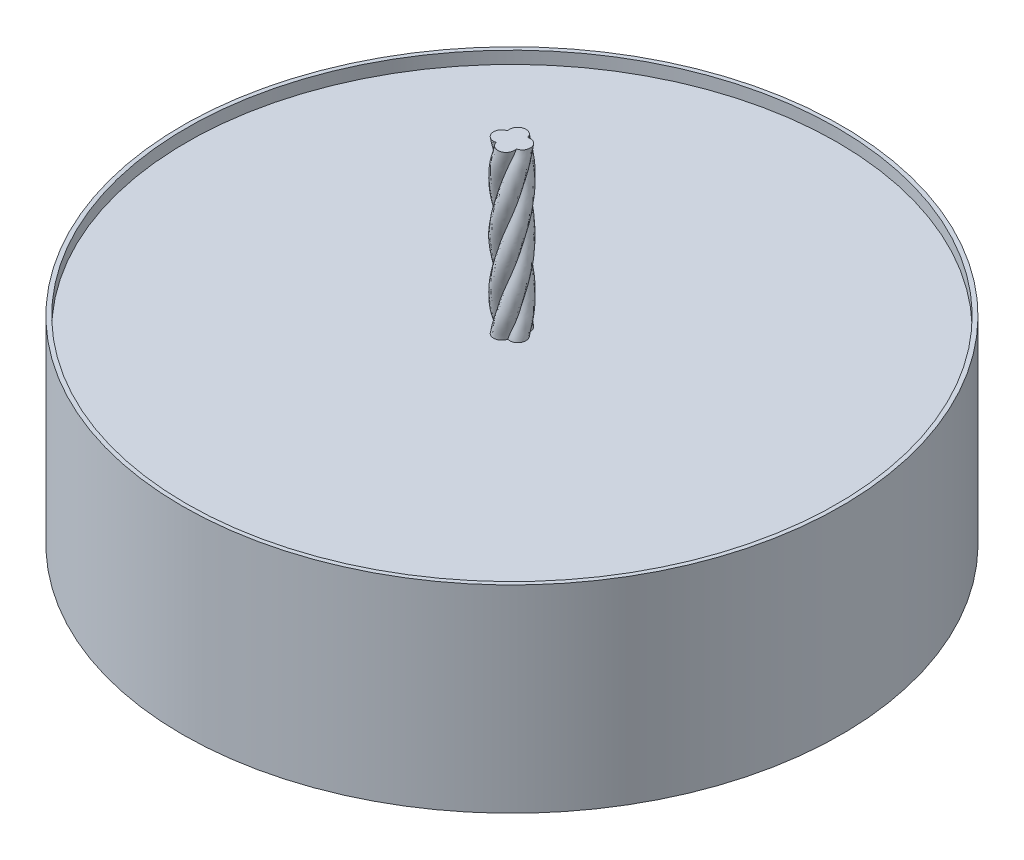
ISO-10303-21;
HEADER;
FILE_DESCRIPTION(('STEP AP214'),'2;1');
FILE_NAME('part.step','',(''),(''),'','','');
FILE_SCHEMA(('AUTOMOTIVE_DESIGN { 1 0 10303 214 1 1 1 1 }'));
ENDSEC;
DATA;
#1=APPLICATION_CONTEXT('core data for automotive mechanical design processes');
#2=APPLICATION_PROTOCOL_DEFINITION('international standard','automotive_design',2000,#1);
#3=PRODUCT_CONTEXT('',#1,'mechanical');
#4=PRODUCT('Part','Part','',(#3));
#5=PRODUCT_RELATED_PRODUCT_CATEGORY('part','',(#4));
#6=PRODUCT_DEFINITION_FORMATION('','',#4);
#7=PRODUCT_DEFINITION_CONTEXT('part definition',#1,'design');
#8=PRODUCT_DEFINITION('design','',#6,#7);
#9=PRODUCT_DEFINITION_SHAPE('','',#8);
#10=(LENGTH_UNIT() NAMED_UNIT(*) SI_UNIT(.MILLI.,.METRE.));
#11=(NAMED_UNIT(*) PLANE_ANGLE_UNIT() SI_UNIT($,.RADIAN.));
#12=(NAMED_UNIT(*) SI_UNIT($,.STERADIAN.) SOLID_ANGLE_UNIT());
#13=UNCERTAINTY_MEASURE_WITH_UNIT(LENGTH_MEASURE(1.E-05),#10,'distance_accuracy_value','');
#14=(GEOMETRIC_REPRESENTATION_CONTEXT(3) GLOBAL_UNCERTAINTY_ASSIGNED_CONTEXT((#13)) GLOBAL_UNIT_ASSIGNED_CONTEXT((#10,
#11,#12)) REPRESENTATION_CONTEXT('',''));
#15=CARTESIAN_POINT('',(0.,0.,0.));
#16=DIRECTION('',(0.,0.,1.));
#17=DIRECTION('',(1.,0.,0.));
#18=AXIS2_PLACEMENT_3D('',#15,#16,#17);
#19=CARTESIAN_POINT('',(-0.548744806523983,22.25,-0.210643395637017));
#20=CARTESIAN_POINT('',(-0.562584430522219,21.9119464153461,-0.183150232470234));
#21=CARTESIAN_POINT('',(-0.585647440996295,21.3485977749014,-0.137334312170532));
#22=CARTESIAN_POINT('',(-0.43022588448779,20.4656045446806,-0.446087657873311));
#23=CARTESIAN_POINT('',(-0.184680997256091,19.5216507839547,-0.586559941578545));
#24=CARTESIAN_POINT('',(0.166694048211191,18.4321052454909,-0.599621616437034));
#25=CARTESIAN_POINT('',(0.463073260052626,17.3408373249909,-0.412651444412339));
#26=CARTESIAN_POINT('',(0.613073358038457,16.25,-0.0971012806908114));
#27=CARTESIAN_POINT('',(0.567925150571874,15.1591626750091,0.249357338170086));
#28=CARTESIAN_POINT('',(0.343828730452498,14.0678947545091,0.518762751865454));
#29=CARTESIAN_POINT('',(0.00561492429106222,12.9783492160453,0.614921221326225));
#30=CARTESIAN_POINT('',(-0.271320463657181,12.0343954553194,0.557201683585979));
#31=CARTESIAN_POINT('',(-0.514545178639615,11.1514022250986,0.311587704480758));
#32=CARTESIAN_POINT('',(-0.478453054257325,10.5880535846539,0.348034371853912));
#33=CARTESIAN_POINT('',(-0.456794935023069,10.25,0.369905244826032));
#34=CARTESIAN_POINT('',(-0.62804106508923,22.25,-0.346938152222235));
#35=CARTESIAN_POINT('',(-0.649396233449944,21.9119464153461,-0.316024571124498));
#36=CARTESIAN_POINT('',(-0.68498350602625,21.3485977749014,-0.26450870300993));
#37=CARTESIAN_POINT('',(-0.445160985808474,20.4656045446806,-0.611673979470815));
#38=CARTESIAN_POINT('',(-0.124668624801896,19.5216507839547,-0.740227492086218));
#39=CARTESIAN_POINT('',(0.302355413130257,18.4321052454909,-0.69694262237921));
#40=CARTESIAN_POINT('',(0.629255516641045,17.3408373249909,-0.421056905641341));
#41=CARTESIAN_POINT('',(0.757558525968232,16.25,-0.0143231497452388));
#42=CARTESIAN_POINT('',(0.644721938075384,15.1591626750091,0.396969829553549));
#43=CARTESIAN_POINT('',(0.328484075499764,14.0678947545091,0.68501534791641));
#44=CARTESIAN_POINT('',(-0.0965985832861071,12.9783492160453,0.744410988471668));
#45=CARTESIAN_POINT('',(-0.421721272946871,12.0343954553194,0.628064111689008));
#46=CARTESIAN_POINT('',(-0.674495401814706,11.1514022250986,0.290212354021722));
#47=CARTESIAN_POINT('',(-0.636986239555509,10.5880535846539,0.340346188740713));
#48=CARTESIAN_POINT('',(-0.614477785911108,10.25,0.370430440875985));
#49=CARTESIAN_POINT('',(-0.652497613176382,22.25,-0.515468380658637));
#50=CARTESIAN_POINT('',(-0.682761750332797,21.9119464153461,-0.484160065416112));
#51=CARTESIAN_POINT('',(-0.73319535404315,21.3485977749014,-0.431986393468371));
#52=CARTESIAN_POINT('',(-0.393323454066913,20.4656045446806,-0.78358460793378));
#53=CARTESIAN_POINT('',(-0.00255633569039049,19.5216507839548,-0.869963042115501));
#54=CARTESIAN_POINT('',(0.477522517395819,18.4321052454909,-0.739712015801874));
#55=CARTESIAN_POINT('',(0.799129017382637,17.3408373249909,-0.362437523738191));
#56=CARTESIAN_POINT('',(0.868911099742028,16.25,0.126891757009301));
#57=CARTESIAN_POINT('',(0.662108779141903,15.1591626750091,0.575829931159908));
#58=CARTESIAN_POINT('',(0.246043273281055,14.0678947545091,0.845378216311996));
#59=CARTESIAN_POINT('',(-0.251234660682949,12.9783492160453,0.832900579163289));
#60=CARTESIAN_POINT('',(-0.600980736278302,12.0343954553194,0.638381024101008));
#61=CARTESIAN_POINT('',(-0.826111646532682,11.1514022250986,0.204272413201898));
#62=CARTESIAN_POINT('',(-0.792704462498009,10.5880535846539,0.268689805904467));
#63=CARTESIAN_POINT('',(-0.772657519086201,10.25,0.30734531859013));
#64=CARTESIAN_POINT('',(-0.539917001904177,22.25,-0.808782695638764));
#65=CARTESIAN_POINT('',(-0.584876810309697,21.9119464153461,-0.784871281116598));
#66=CARTESIAN_POINT('',(-0.659799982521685,21.3485977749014,-0.745024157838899));
#67=CARTESIAN_POINT('',(-0.154892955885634,20.4656045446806,-1.01355379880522));
#68=CARTESIAN_POINT('',(0.310962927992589,19.5216507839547,-0.968688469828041));
#69=CARTESIAN_POINT('',(0.798030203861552,18.4321052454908,-0.650623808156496));
#70=CARTESIAN_POINT('',(1.01970480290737,17.3408373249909,-0.114927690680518));
#71=CARTESIAN_POINT('',(0.920824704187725,16.25,0.454584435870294));
#72=CARTESIAN_POINT('',(0.528835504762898,15.1591626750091,0.87939710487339));
#73=CARTESIAN_POINT('',(-0.0312345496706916,14.0678947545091,1.02916857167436));
#74=CARTESIAN_POINT('',(-0.57991681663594,12.9783492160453,0.835913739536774));
#75=CARTESIAN_POINT('',(-0.898816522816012,12.0343954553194,0.493368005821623));
#76=CARTESIAN_POINT('',(-0.992668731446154,11.1514022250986,-0.0707516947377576));
#77=CARTESIAN_POINT('',(-0.978741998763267,10.5880535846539,0.0129580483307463));
#78=CARTESIAN_POINT('',(-0.970384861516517,10.25,0.063190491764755));
#79=CARTESIAN_POINT('',(-0.410552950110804,22.25,-0.925268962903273));
#80=CARTESIAN_POINT('',(-0.46090714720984,21.9119464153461,-0.908706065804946));
#81=CARTESIAN_POINT('',(-0.544819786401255,21.3485977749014,-0.881104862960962));
#82=CARTESIAN_POINT('',(0.0206672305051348,20.4656045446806,-1.06710928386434));
#83=CARTESIAN_POINT('',(0.490578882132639,19.5216507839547,-0.938561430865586));
#84=CARTESIAN_POINT('',(0.933851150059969,18.4321052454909,-0.526017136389));
#85=CARTESIAN_POINT('',(1.06633892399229,17.3408373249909,0.0627519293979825));
#86=CARTESIAN_POINT('',(0.864021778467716,16.25,0.629421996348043));
#87=CARTESIAN_POINT('',(0.386676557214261,15.1591626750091,0.995739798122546));
#88=CARTESIAN_POINT('',(-0.214356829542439,14.0678947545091,1.05015386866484));
#89=CARTESIAN_POINT('',(-0.742941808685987,12.9783492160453,0.754720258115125));
#90=CARTESIAN_POINT('',(-1.00937651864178,12.0343954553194,0.346855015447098));
#91=CARTESIAN_POINT('',(-1.00571306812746,11.1514022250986,-0.248426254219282));
#92=CARTESIAN_POINT('',(-1.00625668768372,10.5880535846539,-0.1600924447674));
#93=CARTESIAN_POINT('',(-1.00658290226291,10.25,-0.107085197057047));
#94=CARTESIAN_POINT('',(-0.107085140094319,22.25,-1.00658268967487));
#95=CARTESIAN_POINT('',(-0.160092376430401,21.9119464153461,-1.00625647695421));
#96=CARTESIAN_POINT('',(-0.248426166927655,21.3485977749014,-1.0057128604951));
#97=CARTESIAN_POINT('',(0.346854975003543,20.4656045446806,-1.00937629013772));
#98=CARTESIAN_POINT('',(0.754720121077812,19.5216507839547,-0.742941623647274));
#99=CARTESIAN_POINT('',(1.05015365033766,18.4321052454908,-0.214356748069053));
#100=CARTESIAN_POINT('',(0.995739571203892,17.340837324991,0.38667650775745));
#101=CARTESIAN_POINT('',(0.629421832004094,16.25,0.864021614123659));
#102=CARTESIAN_POINT('',(0.0627518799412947,15.1591626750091,1.06633869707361));
#103=CARTESIAN_POINT('',(-0.526017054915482,14.0678947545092,0.933850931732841));
#104=CARTESIAN_POINT('',(-0.938561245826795,12.9783492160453,0.490578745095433));
#105=CARTESIAN_POINT('',(-1.06710905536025,12.0343954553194,0.0206671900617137));
#106=CARTESIAN_POINT('',(-0.881104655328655,11.1514022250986,-0.544819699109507));
#107=CARTESIAN_POINT('',(-0.908705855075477,10.5880535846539,-0.460907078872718));
#108=CARTESIAN_POINT('',(-0.925268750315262,10.25,-0.410552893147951));
#109=CARTESIAN_POINT('',(0.0632766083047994,22.25,-0.970378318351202));
#110=CARTESIAN_POINT('',(0.0130449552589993,21.9119464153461,-0.97873990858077));
#111=CARTESIAN_POINT('',(-0.0706634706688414,21.3485977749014,-0.99267406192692));
#112=CARTESIAN_POINT('',(0.493447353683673,20.4656045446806,-0.898771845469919));
#113=CARTESIAN_POINT('',(0.835964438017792,19.5216507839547,-0.579842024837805));
#114=CARTESIAN_POINT('',(1.02917035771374,18.4321052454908,-0.0311431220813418));
#115=CARTESIAN_POINT('',(0.879349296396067,17.3408373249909,0.528913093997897));
#116=CARTESIAN_POINT('',(0.454502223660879,16.25,0.92086419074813));
#117=CARTESIAN_POINT('',(-0.115018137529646,15.1591626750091,1.01969361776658));
#118=CARTESIAN_POINT('',(-0.650694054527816,14.0678947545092,0.797971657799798));
#119=CARTESIAN_POINT('',(-0.968715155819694,12.9783492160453,0.310876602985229));
#120=CARTESIAN_POINT('',(-1.01353907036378,12.0343954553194,-0.154982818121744));
#121=CARTESIAN_POINT('',(-0.74496484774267,11.1514022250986,-0.659865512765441));
#122=CARTESIAN_POINT('',(-0.784818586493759,10.5880535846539,-0.58494595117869));
#123=CARTESIAN_POINT('',(-0.808733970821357,10.25,-0.539988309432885));
#124=CARTESIAN_POINT('',(0.307104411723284,22.25,-0.772675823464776));
#125=CARTESIAN_POINT('',(0.268446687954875,21.9119464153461,-0.792710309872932));
#126=CARTESIAN_POINT('',(0.204025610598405,21.3485977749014,-0.826096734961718));
#127=CARTESIAN_POINT('',(0.638159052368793,20.4656045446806,-0.601105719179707));
#128=CARTESIAN_POINT('',(0.832758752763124,19.5216507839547,-0.251443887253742));
#129=CARTESIAN_POINT('',(0.845373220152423,18.4321052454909,0.245787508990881));
#130=CARTESIAN_POINT('',(0.575963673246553,17.340837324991,0.661891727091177));
#131=CARTESIAN_POINT('',(0.127121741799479,16.25,0.86880063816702));
#132=CARTESIAN_POINT('',(-0.362184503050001,15.159162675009,0.799160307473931));
#133=CARTESIAN_POINT('',(-0.739515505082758,14.0678947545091,0.477686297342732));
#134=CARTESIAN_POINT('',(-0.869888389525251,12.9783492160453,-0.00231484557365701));
#135=CARTESIAN_POINT('',(-0.783625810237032,12.0343954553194,-0.393072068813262));
#136=CARTESIAN_POINT('',(-0.43215231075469,11.1514022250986,-0.733012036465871));
#137=CARTESIAN_POINT('',(-0.484307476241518,10.5880535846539,-0.682568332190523));
#138=CARTESIAN_POINT('',(-0.515604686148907,10.25,-0.652298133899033));
#139=CARTESIAN_POINT('',(0.355184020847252,22.25,-0.613229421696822));
#140=CARTESIAN_POINT('',(0.325085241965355,21.9119464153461,-0.634936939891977));
#141=CARTESIAN_POINT('',(0.274927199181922,21.3485977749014,-0.671111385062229));
#142=CARTESIAN_POINT('',(0.612942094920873,20.4656045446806,-0.427331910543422));
#143=CARTESIAN_POINT('',(0.73346387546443,19.5216507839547,-0.108273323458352));
#144=CARTESIAN_POINT('',(0.682162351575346,18.4321052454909,0.312540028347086));
#145=CARTESIAN_POINT('',(0.403177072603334,17.3408373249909,0.629820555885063));
#146=CARTESIAN_POINT('',(-0.00103878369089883,16.25,0.748366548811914));
#147=CARTESIAN_POINT('',(-0.404923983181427,15.1591626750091,0.628698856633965));
#148=CARTESIAN_POINT('',(-0.683027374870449,14.0678947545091,0.310645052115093));
#149=CARTESIAN_POINT('',(-0.733160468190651,12.9783492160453,-0.110309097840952));
#150=CARTESIAN_POINT('',(-0.611753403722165,12.0343954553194,-0.429031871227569));
#151=CARTESIAN_POINT('',(-0.273063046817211,11.1514022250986,-0.671872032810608));
#152=CARTESIAN_POINT('',(-0.323321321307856,10.5880535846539,-0.635836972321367));
#153=CARTESIAN_POINT('',(-0.353480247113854,10.25,-0.614213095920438));
#154=CARTESIAN_POINT('',(0.369905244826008,22.25,-0.4567949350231));
#155=CARTESIAN_POINT('',(0.348034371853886,21.9119464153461,-0.478453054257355));
#156=CARTESIAN_POINT('',(0.31158770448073,21.3485977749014,-0.514545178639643));
#157=CARTESIAN_POINT('',(0.557201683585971,20.4656045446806,-0.271320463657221));
#158=CARTESIAN_POINT('',(0.614921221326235,19.5216507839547,0.0056149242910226));
#159=CARTESIAN_POINT('',(0.518762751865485,18.4321052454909,0.34382873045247));
#160=CARTESIAN_POINT('',(0.249357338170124,17.3408373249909,0.567925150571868));
#161=CARTESIAN_POINT('',(-0.0971012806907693,16.25,0.613073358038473));
#162=CARTESIAN_POINT('',(-0.412651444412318,15.1591626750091,0.463073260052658));
#163=CARTESIAN_POINT('',(-0.599621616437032,14.0678947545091,0.166694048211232));
#164=CARTESIAN_POINT('',(-0.586559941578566,12.9783492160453,-0.184680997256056));
#165=CARTESIAN_POINT('',(-0.446087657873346,12.0343954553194,-0.430225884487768));
#166=CARTESIAN_POINT('',(-0.137334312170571,11.1514022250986,-0.585647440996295));
#167=CARTESIAN_POINT('',(-0.183150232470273,10.5880535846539,-0.562584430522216));
#168=CARTESIAN_POINT('',(-0.210643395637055,10.25,-0.548744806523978));
#169=B_SPLINE_SURFACE_WITH_KNOTS('',3,3,((#19,#20,#21,#22,#23,#24,#25,#26,#27,#28,#29,#30,#31,
#32,#33),(#34,#35,#36,#37,#38,#39,#40,#41,#42,#43,#44,#45,#46,#47,#48),(#49,#50,#51,#52,#53,#54,
#55,#56,#57,#58,#59,#60,#61,#62,#63),(#64,#65,#66,#67,#68,#69,#70,#71,#72,#73,#74,#75,#76,#77,
#78),(#79,#80,#81,#82,#83,#84,#85,#86,#87,#88,#89,#90,#91,#92,#93),(#94,#95,#96,#97,#98,#99,
#100,#101,#102,#103,#104,#105,#106,#107,#108),(#109,#110,#111,#112,#113,#114,#115,#116,#117,
#118,#119,#120,#121,#122,#123),(#124,#125,#126,#127,#128,#129,#130,#131,#132,#133,#134,#135,
#136,#137,#138),(#139,#140,#141,#142,#143,#144,#145,#146,#147,#148,#149,#150,#151,#152,#153),
(#154,#155,#156,#157,#158,#159,#160,#161,#162,#163,#164,#165,#166,#167,#168)),.UNSPECIFIED.,.F.,
.F.,.F.,(4,2,2,2,4),(4,1,1,1,1,1,1,1,1,1,1,1,4),(0.,0.25,0.5,0.75,1.),(0.,0.0802222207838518,
0.133686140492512,0.225264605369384,0.316843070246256,0.408421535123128,0.5,0.591578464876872,
0.683156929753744,0.774735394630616,0.866313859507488,0.919777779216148,1.),.UNSPECIFIED.);
#170=CARTESIAN_POINT('',(0.344385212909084,21.2491945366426,-0.605563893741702));
#171=CARTESIAN_POINT('',(0.353058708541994,21.2022179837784,-0.599419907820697));
#172=CARTESIAN_POINT('',(0.363515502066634,21.1558397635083,-0.592001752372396));
#173=CARTESIAN_POINT('',(0.386759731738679,21.0641459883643,-0.575137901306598));
#174=CARTESIAN_POINT('',(0.399541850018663,21.0188282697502,-0.565696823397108));
#175=CARTESIAN_POINT('',(0.426257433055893,20.928889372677,-0.545270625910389));
#176=CARTESIAN_POINT('',(0.440191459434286,20.8842685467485,-0.534284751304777));
#177=CARTESIAN_POINT('',(0.468153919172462,20.7953644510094,-0.511176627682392));
#178=CARTESIAN_POINT('',(0.48218232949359,20.7510811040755,-0.49905464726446));
#179=CARTESIAN_POINT('',(0.502543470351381,20.6846177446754,-0.480288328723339));
#180=CARTESIAN_POINT('',(0.509216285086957,20.6624591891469,-0.473936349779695));
#181=CARTESIAN_POINT('',(0.522191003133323,20.6180762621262,-0.461085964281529));
#182=CARTESIAN_POINT('',(0.528492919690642,20.5958518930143,-0.45458756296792));
#183=CARTESIAN_POINT('',(0.546775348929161,20.5290800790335,-0.434905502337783));
#184=CARTESIAN_POINT('',(0.558136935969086,20.4844198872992,-0.4215309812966));
#185=CARTESIAN_POINT('',(0.599826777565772,20.3079830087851,-0.367875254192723));
#186=CARTESIAN_POINT('',(0.624181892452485,20.1753108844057,-0.325739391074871));
#187=CARTESIAN_POINT('',(0.652097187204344,19.9758749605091,-0.260106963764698));
#188=CARTESIAN_POINT('',(0.659969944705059,19.9092517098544,-0.237798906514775));
#189=CARTESIAN_POINT('',(0.673132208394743,19.7759826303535,-0.192481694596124));
#190=CARTESIAN_POINT('',(0.678421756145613,19.709336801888,-0.169472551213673));
#191=CARTESIAN_POINT('',(0.6867498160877,19.576148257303,-0.122841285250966));
#192=CARTESIAN_POINT('',(0.689789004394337,19.5096055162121,-0.0992193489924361));
#193=CARTESIAN_POINT('',(0.693784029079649,19.376619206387,-0.051521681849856));
#194=CARTESIAN_POINT('',(0.694739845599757,19.3101756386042,-0.0274459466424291));
#195=CARTESIAN_POINT('',(0.694453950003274,19.1774067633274,0.0208131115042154));
#196=CARTESIAN_POINT('',(0.693214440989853,19.1110814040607,0.0449963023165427));
#197=CARTESIAN_POINT('',(0.68847681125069,18.9784567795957,0.0931989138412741));
#198=CARTESIAN_POINT('',(0.684978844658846,18.9121575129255,0.117218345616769));
#199=CARTESIAN_POINT('',(0.675028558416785,18.7707550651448,0.167949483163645));
#200=CARTESIAN_POINT('',(0.6682458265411,18.6956509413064,0.19459554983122));
#201=CARTESIAN_POINT('',(0.651558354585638,18.5454231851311,0.246836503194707));
#202=CARTESIAN_POINT('',(0.64165356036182,18.4702995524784,0.272431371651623));
#203=CARTESIAN_POINT('',(0.607216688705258,18.2450909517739,0.346935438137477));
#204=CARTESIAN_POINT('',(0.577948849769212,18.0949750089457,0.393635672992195));
#205=CARTESIAN_POINT('',(0.509239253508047,17.7948202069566,0.478947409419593));
#206=CARTESIAN_POINT('',(0.46979891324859,17.6447813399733,0.517560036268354));
#207=CARTESIAN_POINT('',(0.404706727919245,17.4196689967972,0.567772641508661));
#208=CARTESIAN_POINT('',(0.382006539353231,17.3445810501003,0.583232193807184));
#209=CARTESIAN_POINT('',(0.334936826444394,17.1943905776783,0.611343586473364));
#210=CARTESIAN_POINT('',(0.310566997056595,17.1192880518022,0.623994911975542));
#211=CARTESIAN_POINT('',(0.234906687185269,16.892167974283,0.657843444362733));
#212=CARTESIAN_POINT('',(0.181594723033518,16.7401121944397,0.674532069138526));
#213=CARTESIAN_POINT('',(0.0998856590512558,16.5120274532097,0.689877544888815));
#214=CARTESIAN_POINT('',(0.0723509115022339,16.4359770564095,0.693377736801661));
#215=CARTESIAN_POINT('',(0.0170752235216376,16.2838710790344,0.697002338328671));
#216=CARTESIAN_POINT('',(-0.0106657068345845,16.2078154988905,0.697126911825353));
#217=CARTESIAN_POINT('',(-0.0936288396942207,15.9796498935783,0.69244754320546));
#218=CARTESIAN_POINT('',(-0.148595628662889,15.8275294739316,0.682591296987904));
#219=CARTESIAN_POINT('',(-0.254795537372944,15.5233635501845,0.650423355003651));
#220=CARTESIAN_POINT('',(-0.30602995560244,15.371318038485,0.628116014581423));
#221=CARTESIAN_POINT('',(-0.378868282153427,15.1399535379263,0.585364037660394));
#222=CARTESIAN_POINT('',(-0.402929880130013,15.0606091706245,0.569125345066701));
#223=CARTESIAN_POINT('',(-0.448848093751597,14.901930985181,0.533772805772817));
#224=CARTESIAN_POINT('',(-0.47070500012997,14.8225971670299,0.51465933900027));
#225=CARTESIAN_POINT('',(-0.511852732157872,14.6640067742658,0.473905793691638));
#226=CARTESIAN_POINT('',(-0.531146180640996,14.5847502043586,0.452268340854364));
#227=CARTESIAN_POINT('',(-0.566848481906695,14.42622597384,0.406765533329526));
#228=CARTESIAN_POINT('',(-0.583257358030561,14.3469583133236,0.382900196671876));
#229=CARTESIAN_POINT('',(-0.612764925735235,14.1887309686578,0.333352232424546));
#230=CARTESIAN_POINT('',(-0.625876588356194,14.1097713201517,0.307677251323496));
#231=CARTESIAN_POINT('',(-0.648580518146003,13.9518666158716,0.254773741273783));
#232=CARTESIAN_POINT('',(-0.658172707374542,13.8729215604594,0.227545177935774));
#233=CARTESIAN_POINT('',(-0.673995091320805,13.7149863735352,0.172056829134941));
#234=CARTESIAN_POINT('',(-0.680222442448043,13.6359962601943,0.143796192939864));
#235=CARTESIAN_POINT('',(-0.689418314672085,13.4780114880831,0.0867819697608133));
#236=CARTESIAN_POINT('',(-0.692386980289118,13.3990168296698,0.0580284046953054));
#237=CARTESIAN_POINT('',(-0.695289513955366,13.2351508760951,-0.00158131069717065));
#238=CARTESIAN_POINT('',(-0.694984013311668,13.1502748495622,-0.0324364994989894));
#239=CARTESIAN_POINT('',(-0.69193507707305,13.0228379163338,-0.0782343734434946));
#240=CARTESIAN_POINT('',(-0.690486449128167,12.9803301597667,-0.0934224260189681));
#241=CARTESIAN_POINT('',(-0.686717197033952,12.8952732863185,-0.123572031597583));
#242=CARTESIAN_POINT('',(-0.684396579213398,12.8527241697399,-0.138533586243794));
#243=CARTESIAN_POINT('',(-0.675993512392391,12.7250872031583,-0.183039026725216));
#244=CARTESIAN_POINT('',(-0.668468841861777,12.639960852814,-0.212221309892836));
#245=CARTESIAN_POINT('',(-0.648950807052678,12.4698868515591,-0.269391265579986));
#246=CARTESIAN_POINT('',(-0.636961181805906,12.3849391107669,-0.297379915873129));
#247=CARTESIAN_POINT('',(-0.612423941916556,12.2417535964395,-0.343494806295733));
#248=CARTESIAN_POINT('',(-0.601203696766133,12.1834063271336,-0.361986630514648));
#249=CARTESIAN_POINT('',(-0.582433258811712,12.0961202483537,-0.389171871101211));
#250=CARTESIAN_POINT('',(-0.575851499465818,12.0670578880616,-0.398143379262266));
#251=CARTESIAN_POINT('',(-0.562026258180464,12.0090312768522,-0.415889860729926));
#252=CARTESIAN_POINT('',(-0.554782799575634,11.9800670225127,-0.424664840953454));
#253=CARTESIAN_POINT('',(-0.539591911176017,11.9222306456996,-0.442022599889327));
#254=CARTESIAN_POINT('',(-0.531643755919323,11.893358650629,-0.450605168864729));
#255=CARTESIAN_POINT('',(-0.515101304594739,11.8357327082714,-0.467538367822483));
#256=CARTESIAN_POINT('',(-0.506506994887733,11.8069787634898,-0.475888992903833));
#257=CARTESIAN_POINT('',(-0.488954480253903,11.74938297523,-0.492275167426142));
#258=CARTESIAN_POINT('',(-0.479995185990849,11.7205411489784,-0.500309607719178));
#259=CARTESIAN_POINT('',(-0.462010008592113,11.6627574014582,-0.515933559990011));
#260=CARTESIAN_POINT('',(-0.452984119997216,11.6338154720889,-0.523523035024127));
#261=CARTESIAN_POINT('',(-0.426247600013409,11.5467429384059,-0.545445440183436));
#262=CARTESIAN_POINT('',(-0.408853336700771,11.4882896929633,-0.558954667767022));
#263=CARTESIAN_POINT('',(-0.385228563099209,11.3994320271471,-0.576804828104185));
#264=CARTESIAN_POINT('',(-0.377762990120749,11.3696079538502,-0.582353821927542));
#265=CARTESIAN_POINT('',(-0.36399887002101,11.3094985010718,-0.592497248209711));
#266=CARTESIAN_POINT('',(-0.357701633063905,11.279212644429,-0.597090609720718));
#267=CARTESIAN_POINT('',(-0.352168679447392,11.2486921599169,-0.601125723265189));
#268=B_SPLINE_CURVE_WITH_KNOTS('',3,(#170,#171,#172,#173,#174,#175,#176,#177,#178,#179,#180,
#181,#182,#183,#184,#185,#186,#187,#188,#189,#190,#191,#192,#193,#194,#195,#196,#197,#198,#199,
#200,#201,#202,#203,#204,#205,#206,#207,#208,#209,#210,#211,#212,#213,#214,#215,#216,#217,#218,
#219,#220,#221,#222,#223,#224,#225,#226,#227,#228,#229,#230,#231,#232,#233,#234,#235,#236,#237,
#238,#239,#240,#241,#242,#243,#244,#245,#246,#247,#248,#249,#250,#251,#252,#253,#254,#255,#256,
#257,#258,#259,#260,#261,#262,#263,#264,#265,#266,#267),.UNSPECIFIED.,.F.,.F.,(4,2,2,2,2,2,2,2,
2,2,2,2,2,2,2,2,2,2,2,2,2,2,2,2,2,2,2,2,2,2,2,2,2,2,2,2,2,2,2,2,2,2,2,2,2,2,2,2,4),(0.,
0.144299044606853,0.288272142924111,0.432315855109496,0.576325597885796,0.648315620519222,
0.720303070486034,0.864232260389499,1.28742994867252,1.49949456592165,1.7115557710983,
1.92355323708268,2.13555272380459,2.34733958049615,2.55911198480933,2.79898306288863,
3.03885830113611,3.51799139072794,3.99705777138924,4.23685602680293,4.47669821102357,
4.96205158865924,5.20486861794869,5.44767385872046,5.93324752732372,6.41865145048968,
6.67204611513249,6.92540732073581,7.17850726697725,7.43160516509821,7.6836912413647,
7.93578289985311,8.18808726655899,8.44038044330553,8.71123705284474,8.84671817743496,
8.98219831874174,9.25300281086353,9.52358103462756,9.71020589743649,9.80355793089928,
9.89690667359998,9.99035265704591,10.0838006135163,10.1775515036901,10.2713101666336,
10.4585788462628,10.5522658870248,10.6460573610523),.UNSPECIFIED.);
#269=CARTESIAN_POINT('',(0.349085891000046,21.2494802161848,-0.610007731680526));
#270=VERTEX_POINT('',#269);
#271=CARTESIAN_POINT('',(-0.353333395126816,11.2492822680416,-0.60718621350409));
#272=VERTEX_POINT('',#271);
#273=EDGE_CURVE('E203',#270,#272,#268,.T.);
#274=CARTESIAN_POINT('',(-0.354827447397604,11.25,-0.601604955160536));
#275=CARTESIAN_POINT('',(-0.38446674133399,11.25,-0.609549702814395));
#276=CARTESIAN_POINT('',(-0.414812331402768,11.25,-0.615704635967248));
#277=CARTESIAN_POINT('',(-0.476179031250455,11.25,-0.62313097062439));
#278=CARTESIAN_POINT('',(-0.507202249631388,11.25,-0.624383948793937));
#279=CARTESIAN_POINT('',(-0.562510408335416,11.25,-0.621015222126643));
#280=CARTESIAN_POINT('',(-0.58685083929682,11.25,-0.617564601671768));
#281=CARTESIAN_POINT('',(-0.622548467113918,11.25,-0.609174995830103));
#282=CARTESIAN_POINT('',(-0.6342980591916,11.25,-0.605848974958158));
#283=CARTESIAN_POINT('',(-0.657438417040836,11.25,-0.598116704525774));
#284=CARTESIAN_POINT('',(-0.668829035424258,11.25,-0.593710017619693));
#285=CARTESIAN_POINT('',(-0.702324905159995,11.25,-0.579252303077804));
#286=CARTESIAN_POINT('',(-0.723890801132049,11.25,-0.567927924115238));
#287=CARTESIAN_POINT('',(-0.765168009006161,11.25,-0.54221448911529));
#288=CARTESIAN_POINT('',(-0.784874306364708,11.25,-0.52781746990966));
#289=CARTESIAN_POINT('',(-0.824647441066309,11.25,-0.494178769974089));
#290=CARTESIAN_POINT('',(-0.844381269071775,11.25,-0.474541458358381));
#291=CARTESIAN_POINT('',(-0.880464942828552,11.25,-0.432372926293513));
#292=CARTESIAN_POINT('',(-0.89681389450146,11.25,-0.409840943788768));
#293=CARTESIAN_POINT('',(-0.926315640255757,11.25,-0.36127161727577));
#294=CARTESIAN_POINT('',(-0.939282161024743,11.25,-0.335119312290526));
#295=CARTESIAN_POINT('',(-0.955065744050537,11.25,-0.294504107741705));
#296=CARTESIAN_POINT('',(-0.959716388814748,11.25,-0.280732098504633));
#297=CARTESIAN_POINT('',(-0.967722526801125,11.25,-0.252813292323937));
#298=CARTESIAN_POINT('',(-0.971077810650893,11.25,-0.238666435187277));
#299=CARTESIAN_POINT('',(-0.978865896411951,11.25,-0.19757327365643));
#300=CARTESIAN_POINT('',(-0.981655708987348,11.25,-0.170300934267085));
#301=CARTESIAN_POINT('',(-0.982788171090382,11.25,-0.115665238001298));
#302=CARTESIAN_POINT('',(-0.981126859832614,11.25,-0.0883018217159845));
#303=CARTESIAN_POINT('',(-0.973400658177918,11.25,-0.033365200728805));
#304=CARTESIAN_POINT('',(-0.967205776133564,11.25,-0.00581012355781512));
#305=CARTESIAN_POINT('',(-0.950421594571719,11.25,0.047922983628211));
#306=CARTESIAN_POINT('',(-0.9398324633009,11.25,0.07410106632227));
#307=CARTESIAN_POINT('',(-0.914021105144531,11.25,0.125067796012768));
#308=CARTESIAN_POINT('',(-0.898673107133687,11.25,0.149793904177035));
#309=CARTESIAN_POINT('',(-0.872477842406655,11.25,0.184433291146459));
#310=CARTESIAN_POINT('',(-0.863217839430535,11.25,0.195570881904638));
#311=CARTESIAN_POINT('',(-0.843660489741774,11.25,0.216894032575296));
#312=CARTESIAN_POINT('',(-0.833363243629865,11.25,0.227079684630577));
#313=CARTESIAN_POINT('',(-0.802955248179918,11.25,0.254468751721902));
#314=CARTESIAN_POINT('',(-0.781775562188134,11.25,0.270503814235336));
#315=CARTESIAN_POINT('',(-0.737149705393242,11.25,0.299009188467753));
#316=CARTESIAN_POINT('',(-0.713701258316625,11.25,0.311475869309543));
#317=CARTESIAN_POINT('',(-0.662676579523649,11.25,0.333936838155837));
#318=CARTESIAN_POINT('',(-0.634925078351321,11.25,0.343536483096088));
#319=CARTESIAN_POINT('',(-0.606642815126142,11.25,0.35094646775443));
#320=B_SPLINE_CURVE_WITH_KNOTS('',3,(#274,#275,#276,#277,#278,#279,#280,#281,#282,#283,#284,
#285,#286,#287,#288,#289,#290,#291,#292,#293,#294,#295,#296,#297,#298,#299,#300,#301,#302,#303,
#304,#305,#306,#307,#308,#309,#310,#311,#312,#313,#314,#315,#316,#317,#318,#319),.UNSPECIFIED.,
.F.,.F.,(4,2,2,2,2,2,2,2,2,2,2,2,2,2,2,2,2,2,2,2,2,2,4),(0.,0.0923436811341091,
0.185034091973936,0.258386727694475,0.294972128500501,0.331572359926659,0.404353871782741,
0.477326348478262,0.56047586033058,0.643647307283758,0.730726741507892,0.774281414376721,
0.81784312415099,0.899674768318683,0.981579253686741,1.06592906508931,1.15027564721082,
1.23707493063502,1.28046953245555,1.32385992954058,1.40315968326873,1.4825398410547,
1.57021739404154),.UNSPECIFIED.);
#321=CARTESIAN_POINT('',(-0.607367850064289,11.2493089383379,0.353713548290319));
#322=VERTEX_POINT('',#321);
#323=EDGE_CURVE('E202',#272,#322,#320,.T.);
#324=CARTESIAN_POINT('',(-0.605563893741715,21.2491945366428,-0.344385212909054));
#325=CARTESIAN_POINT('',(-0.599419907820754,21.2022179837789,-0.353058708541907));
#326=CARTESIAN_POINT('',(-0.592001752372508,21.1558397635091,-0.363515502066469));
#327=CARTESIAN_POINT('',(-0.575137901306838,21.0641459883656,-0.386759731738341));
#328=CARTESIAN_POINT('',(-0.565696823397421,21.0188282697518,-0.39954185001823));
#329=CARTESIAN_POINT('',(-0.54527062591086,20.9288893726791,-0.426257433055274));
#330=CARTESIAN_POINT('',(-0.534284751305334,20.8842685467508,-0.440191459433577));
#331=CARTESIAN_POINT('',(-0.511176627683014,20.7953644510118,-0.468153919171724));
#332=CARTESIAN_POINT('',(-0.499054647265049,20.7510811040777,-0.482182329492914));
#333=CARTESIAN_POINT('',(-0.480288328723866,20.6846177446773,-0.502543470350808));
#334=CARTESIAN_POINT('',(-0.473936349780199,20.6624591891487,-0.50921628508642));
#335=CARTESIAN_POINT('',(-0.461085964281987,20.6180762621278,-0.522191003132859));
#336=CARTESIAN_POINT('',(-0.454587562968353,20.5958518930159,-0.528492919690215));
#337=CARTESIAN_POINT('',(-0.434905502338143,20.5290800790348,-0.546775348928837));
#338=CARTESIAN_POINT('',(-0.421530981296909,20.4844198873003,-0.558136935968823));
#339=CARTESIAN_POINT('',(-0.367875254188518,20.3079830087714,-0.599826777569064));
#340=CARTESIAN_POINT('',(-0.325739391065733,20.175310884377,-0.624181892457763));
#341=CARTESIAN_POINT('',(-0.260106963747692,19.9758749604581,-0.652097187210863));
#342=CARTESIAN_POINT('',(-0.237798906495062,19.9092517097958,-0.659969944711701));
#343=CARTESIAN_POINT('',(-0.192481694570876,19.7759826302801,-0.673132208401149));
#344=CARTESIAN_POINT('',(-0.169472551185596,19.7093368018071,-0.678421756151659));
#345=CARTESIAN_POINT('',(-0.122841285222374,19.5761482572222,-0.686749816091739));
#346=CARTESIAN_POINT('',(-0.0992193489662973,19.5096055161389,-0.689789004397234));
#347=CARTESIAN_POINT('',(-0.0515216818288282,19.3766192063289,-0.693784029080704));
#348=CARTESIAN_POINT('',(-0.0274459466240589,19.3101756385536,-0.694739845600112));
#349=CARTESIAN_POINT('',(0.0208131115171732,19.1774067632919,-0.694453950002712));
#350=CARTESIAN_POINT('',(0.0449963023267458,19.1110814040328,-0.693214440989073));
#351=CARTESIAN_POINT('',(0.093198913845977,18.9784567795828,-0.688476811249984));
#352=CARTESIAN_POINT('',(0.117218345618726,18.9121575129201,-0.684978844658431));
#353=CARTESIAN_POINT('',(0.167949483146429,18.7707550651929,-0.675028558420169));
#354=CARTESIAN_POINT('',(0.194595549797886,18.6956509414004,-0.668245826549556));
#355=CARTESIAN_POINT('',(0.246836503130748,18.545423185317,-0.651558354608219));
#356=CARTESIAN_POINT('',(0.272431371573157,18.4702995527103,-0.641653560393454));
#357=CARTESIAN_POINT('',(0.346935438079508,18.24509095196,-0.607216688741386));
#358=CARTESIAN_POINT('',(0.393635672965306,18.0949750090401,-0.577948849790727));
#359=CARTESIAN_POINT('',(0.478947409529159,17.7948202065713,-0.509239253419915));
#360=CARTESIAN_POINT('',(0.517560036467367,17.6447813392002,-0.469798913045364));
#361=CARTESIAN_POINT('',(0.567772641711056,17.4196689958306,-0.404706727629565));
#362=CARTESIAN_POINT('',(0.583232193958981,17.3445810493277,-0.382006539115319));
#363=CARTESIAN_POINT('',(0.611343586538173,17.1943905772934,-0.334936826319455));
#364=CARTESIAN_POINT('',(0.62399491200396,17.1192880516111,-0.31056699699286));
#365=CARTESIAN_POINT('',(0.657843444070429,16.8921679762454,-0.234906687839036));
#366=CARTESIAN_POINT('',(0.674532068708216,16.7401121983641,-0.181594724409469));
#367=CARTESIAN_POINT('',(0.689877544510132,16.5120274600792,-0.0998856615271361));
#368=CARTESIAN_POINT('',(0.693377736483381,16.4359770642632,-0.0723509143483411));
#369=CARTESIAN_POINT('',(0.697002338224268,16.2838710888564,-0.0170752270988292));
#370=CARTESIAN_POINT('',(0.697126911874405,16.2078155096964,0.0106657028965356));
#371=CARTESIAN_POINT('',(0.692447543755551,15.9796499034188,0.0936288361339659));
#372=CARTESIAN_POINT('',(0.682591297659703,15.8275294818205,0.148595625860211));
#373=CARTESIAN_POINT('',(0.650423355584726,15.5233635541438,0.254795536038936));
#374=CARTESIAN_POINT('',(0.628116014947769,15.3713180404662,0.306029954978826));
#375=CARTESIAN_POINT('',(0.58536403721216,15.1399535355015,0.378868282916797));
#376=CARTESIAN_POINT('',(0.569125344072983,15.0606091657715,0.402929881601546));
#377=CARTESIAN_POINT('',(0.53377280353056,14.9019309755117,0.44884809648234));
#378=CARTESIAN_POINT('',(0.514659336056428,14.8225971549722,0.470705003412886));
#379=CARTESIAN_POINT('',(0.473905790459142,14.6640067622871,0.511852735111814));
#380=CARTESIAN_POINT('',(0.4522683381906,14.5847501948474,0.531146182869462));
#381=CARTESIAN_POINT('',(0.406765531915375,14.426225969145,0.566848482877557));
#382=CARTESIAN_POINT('',(0.382900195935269,14.3469583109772,0.583257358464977));
#383=CARTESIAN_POINT('',(0.333352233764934,14.1887309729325,0.612764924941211));
#384=CARTESIAN_POINT('',(0.307677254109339,14.1097713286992,0.625876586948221));
#385=CARTESIAN_POINT('',(0.254773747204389,13.9518666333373,0.648580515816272));
#386=CARTESIAN_POINT('',(0.227545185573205,13.8729215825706,0.658172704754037));
#387=CARTESIAN_POINT('',(0.172056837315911,13.7149863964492,0.673995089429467));
#388=CARTESIAN_POINT('',(0.143796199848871,13.635996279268,0.680222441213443));
#389=CARTESIAN_POINT('',(0.0867819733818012,13.4780114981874,0.689418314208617));
#390=CARTESIAN_POINT('',(0.0580284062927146,13.3990168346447,0.692386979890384));
#391=CARTESIAN_POINT('',(-0.00158034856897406,13.2351535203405,0.695289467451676));
#392=CARTESIAN_POINT('',(-0.0324345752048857,13.150280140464,0.694984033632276));
#393=CARTESIAN_POINT('',(-0.0782310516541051,13.0228471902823,0.691935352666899));
#394=CARTESIAN_POINT('',(-0.0934186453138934,12.9803407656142,0.690486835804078));
#395=CARTESIAN_POINT('',(-0.123567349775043,12.8952865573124,0.686717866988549));
#396=CARTESIAN_POINT('',(-0.138528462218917,12.852738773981,0.684397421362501));
#397=CARTESIAN_POINT('',(-0.183032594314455,12.7251058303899,0.675994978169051));
#398=CARTESIAN_POINT('',(-0.212214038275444,12.6399821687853,0.668470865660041));
#399=CARTESIAN_POINT('',(-0.269382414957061,12.4699134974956,0.648954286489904));
#400=CARTESIAN_POINT('',(-0.297370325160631,12.3849683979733,0.636965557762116));
#401=CARTESIAN_POINT('',(-0.343484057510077,12.2417873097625,0.612430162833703));
#402=CARTESIAN_POINT('',(-0.361975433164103,12.183441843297,0.601210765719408));
#403=CARTESIAN_POINT('',(-0.389160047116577,12.096158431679,0.582441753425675));
#404=CARTESIAN_POINT('',(-0.398131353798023,12.0670969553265,0.575860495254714));
#405=CARTESIAN_POINT('',(-0.415877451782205,12.0090720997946,0.562036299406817));
#406=CARTESIAN_POINT('',(-0.424652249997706,11.980108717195,0.554793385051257));
#407=CARTESIAN_POINT('',(-0.44200965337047,11.9222740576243,0.539603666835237));
#408=CARTESIAN_POINT('',(-0.450592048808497,11.8934029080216,0.531656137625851));
#409=CARTESIAN_POINT('',(-0.467524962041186,11.8357786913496,0.515114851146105));
#410=CARTESIAN_POINT('',(-0.475875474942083,11.8070256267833,0.506521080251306));
#411=CARTESIAN_POINT('',(-0.492261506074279,11.7494316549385,0.488969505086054));
#412=CARTESIAN_POINT('',(-0.500295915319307,11.7205907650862,0.48001061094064));
#413=CARTESIAN_POINT('',(-0.515919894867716,11.6628089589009,0.462026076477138));
#414=CARTESIAN_POINT('',(-0.523509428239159,11.633868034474,0.453000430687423));
#415=CARTESIAN_POINT('',(-0.545432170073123,11.5467986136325,0.426264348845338));
#416=CARTESIAN_POINT('',(-0.558941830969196,11.488347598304,0.40886999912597));
#417=CARTESIAN_POINT('',(-0.576793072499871,11.3994935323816,0.385244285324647));
#418=CARTESIAN_POINT('',(-0.582342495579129,11.3696707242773,0.377778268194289));
#419=CARTESIAN_POINT('',(-0.592486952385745,11.3095638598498,0.36401293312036));
#420=CARTESIAN_POINT('',(-0.597080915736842,11.2792793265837,0.357714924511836));
#421=CARTESIAN_POINT('',(-0.601116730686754,11.2487601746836,0.352181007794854));
#422=B_SPLINE_CURVE_WITH_KNOTS('',3,(#324,#325,#326,#327,#328,#329,#330,#331,#332,#333,#334,
#335,#336,#337,#338,#339,#340,#341,#342,#343,#344,#345,#346,#347,#348,#349,#350,#351,#352,#353,
#354,#355,#356,#357,#358,#359,#360,#361,#362,#363,#364,#365,#366,#367,#368,#369,#370,#371,#372,
#373,#374,#375,#376,#377,#378,#379,#380,#381,#382,#383,#384,#385,#386,#387,#388,#389,#390,#391,
#392,#393,#394,#395,#396,#397,#398,#399,#400,#401,#402,#403,#404,#405,#406,#407,#408,#409,#410,
#411,#412,#413,#414,#415,#416,#417,#418,#419,#420,#421),.UNSPECIFIED.,.F.,.F.,(4,2,2,2,2,2,2,2,
2,2,2,2,2,2,2,2,2,2,2,2,2,2,2,2,2,2,2,2,2,2,2,2,2,2,2,2,2,2,2,2,2,2,2,2,2,2,2,2,4),(0.,
0.144299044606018,0.288272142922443,0.43231585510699,0.576325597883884,0.648315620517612,
0.720303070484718,0.86423226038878,1.28742994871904,1.4994945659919,1.71155577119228,
1.92355323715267,2.13555272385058,2.34733958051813,2.55911198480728,2.7989830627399,
3.03885830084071,3.51799139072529,3.99705777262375,4.23685602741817,4.47669821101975,
4.96205158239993,5.20486860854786,5.44767384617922,5.93324752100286,6.41865145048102,
6.67204612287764,6.92540733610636,7.17850727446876,7.43160516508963,7.68369122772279,
7.93578287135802,8.18808725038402,8.44038044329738,8.71122861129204,8.84670550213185,
8.9821814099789,9.2529773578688,9.52354709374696,9.71016603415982,9.80351509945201,
9.89686087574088,9.99030388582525,10.0837488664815,10.1774967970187,10.2712524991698,
10.4585153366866,10.5521993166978,10.6459876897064),.UNSPECIFIED.);
#423=CARTESIAN_POINT('',(-0.610007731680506,21.2494802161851,-0.349085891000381));
#424=VERTEX_POINT('',#423);
#425=EDGE_CURVE('E191',#424,#322,#422,.T.);
#426=CARTESIAN_POINT('',(0.34348158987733,21.25,-0.608501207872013));
#427=CARTESIAN_POINT('',(0.335533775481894,21.25,-0.638107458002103));
#428=CARTESIAN_POINT('',(0.325684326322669,21.25,-0.667428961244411));
#429=CARTESIAN_POINT('',(0.301425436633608,21.25,-0.724213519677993));
#430=CARTESIAN_POINT('',(0.286999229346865,21.25,-0.751669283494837));
#431=CARTESIAN_POINT('',(0.25642398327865,21.25,-0.797839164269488));
#432=CARTESIAN_POINT('',(0.241256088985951,21.25,-0.817184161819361));
#433=CARTESIAN_POINT('',(0.216128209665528,21.25,-0.84388891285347));
#434=CARTESIAN_POINT('',(0.207368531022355,21.25,-0.852395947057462));
#435=CARTESIAN_POINT('',(0.189094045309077,21.25,-0.868559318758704));
#436=CARTESIAN_POINT('',(0.179578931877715,21.25,-0.876215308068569));
#437=CARTESIAN_POINT('',(0.15030122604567,21.25,-0.897979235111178));
#438=CARTESIAN_POINT('',(0.129706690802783,21.25,-0.910983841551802));
#439=CARTESIAN_POINT('',(0.0867925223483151,21.25,-0.933854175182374));
#440=CARTESIAN_POINT('',(0.064468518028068,21.25,-0.943711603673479));
#441=CARTESIAN_POINT('',(0.0154409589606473,21.25,-0.961317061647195));
#442=CARTESIAN_POINT('',(-0.0114387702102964,21.25,-0.968578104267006));
#443=CARTESIAN_POINT('',(-0.0660107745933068,21.25,-0.978721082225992));
#444=CARTESIAN_POINT('',(-0.0937032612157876,21.25,-0.981601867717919));
#445=CARTESIAN_POINT('',(-0.150520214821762,21.25,-0.98284051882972));
#446=CARTESIAN_POINT('',(-0.17965098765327,21.25,-0.980980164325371));
#447=CARTESIAN_POINT('',(-0.22271306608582,21.25,-0.974320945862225));
#448=CARTESIAN_POINT('',(-0.236963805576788,21.25,-0.97145560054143));
#449=CARTESIAN_POINT('',(-0.265141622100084,21.25,-0.964415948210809));
#450=CARTESIAN_POINT('',(-0.279068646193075,21.25,-0.96024142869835));
#451=CARTESIAN_POINT('',(-0.318541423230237,21.25,-0.946421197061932));
#452=CARTESIAN_POINT('',(-0.343547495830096,21.25,-0.935190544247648));
#453=CARTESIAN_POINT('',(-0.39141378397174,21.25,-0.908834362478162));
#454=CARTESIAN_POINT('',(-0.414272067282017,21.25,-0.893705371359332));
#455=CARTESIAN_POINT('',(-0.457971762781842,21.25,-0.859527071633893));
#456=CARTESIAN_POINT('',(-0.478731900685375,21.25,-0.840373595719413));
#457=CARTESIAN_POINT('',(-0.516859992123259,21.25,-0.798950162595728));
#458=CARTESIAN_POINT('',(-0.534228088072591,21.25,-0.776680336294));
#459=CARTESIAN_POINT('',(-0.565439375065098,21.25,-0.728827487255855));
#460=CARTESIAN_POINT('',(-0.579166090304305,21.25,-0.703167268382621));
#461=CARTESIAN_POINT('',(-0.596046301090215,21.25,-0.663155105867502));
#462=CARTESIAN_POINT('',(-0.601054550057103,21.25,-0.649564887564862));
#463=CARTESIAN_POINT('',(-0.609727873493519,21.25,-0.621962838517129));
#464=CARTESIAN_POINT('',(-0.613393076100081,21.25,-0.607951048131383));
#465=CARTESIAN_POINT('',(-0.621888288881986,21.25,-0.567921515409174));
#466=CARTESIAN_POINT('',(-0.625172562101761,21.25,-0.541563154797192));
#467=CARTESIAN_POINT('',(-0.627522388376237,21.25,-0.488668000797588));
#468=CARTESIAN_POINT('',(-0.62658368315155,21.25,-0.462131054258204));
#469=CARTESIAN_POINT('',(-0.62050736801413,21.25,-0.406770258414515));
#470=CARTESIAN_POINT('',(-0.614948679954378,21.25,-0.377991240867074));
#471=CARTESIAN_POINT('',(-0.607236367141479,21.25,-0.349845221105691));
#472=B_SPLINE_CURVE_WITH_KNOTS('',3,(#426,#427,#428,#429,#430,#431,#432,#433,#434,#435,#436,
#437,#438,#439,#440,#441,#442,#443,#444,#445,#446,#447,#448,#449,#450,#451,#452,#453,#454,#455,
#456,#457,#458,#459,#460,#461,#462,#463,#464,#465,#466,#467,#468,#469,#470,#471),.UNSPECIFIED.,
.F.,.F.,(4,2,2,2,2,2,2,2,2,2,2,2,2,2,2,2,2,2,2,2,2,2,4),(0.,0.0922490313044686,
0.184839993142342,0.258188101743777,0.294771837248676,0.331370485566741,0.404147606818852,
0.477115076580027,0.560274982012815,0.643456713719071,0.730535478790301,0.774089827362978,
0.817651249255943,0.899475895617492,0.98137346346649,1.06573268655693,1.15008836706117,
1.23688379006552,1.28027661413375,1.32366529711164,1.40295674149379,1.48232815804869,
1.56984609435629),.UNSPECIFIED.);
#473=EDGE_CURVE('E293',#270,#424,#472,.T.);
#474=ORIENTED_EDGE('',*,*,#273,.T.);
#475=ORIENTED_EDGE('',*,*,#323,.T.);
#476=ORIENTED_EDGE('',*,*,#425,.F.);
#477=ORIENTED_EDGE('',*,*,#473,.F.);
#478=EDGE_LOOP('',(#474,#475,#476,#477));
#479=FACE_BOUND('',#478,.T.);
#480=ADVANCED_FACE('F148',(#479),#169,.T.);
#481=CARTESIAN_POINT('',(-0.210643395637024,22.25,0.548744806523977));
#482=CARTESIAN_POINT('',(-0.183150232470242,21.9119464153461,0.562584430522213));
#483=CARTESIAN_POINT('',(-0.13733431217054,21.3485977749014,0.58564744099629));
#484=CARTESIAN_POINT('',(-0.446087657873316,20.4656045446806,0.430225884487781));
#485=CARTESIAN_POINT('',(-0.586559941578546,19.5216507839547,0.18468099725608));
#486=CARTESIAN_POINT('',(-0.599621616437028,18.4321052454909,-0.1666940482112));
#487=CARTESIAN_POINT('',(-0.412651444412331,17.3408373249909,-0.46307326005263));
#488=CARTESIAN_POINT('',(-0.097101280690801,16.25,-0.613073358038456));
#489=CARTESIAN_POINT('',(0.249357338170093,15.1591626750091,-0.567925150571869));
#490=CARTESIAN_POINT('',(0.518762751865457,14.0678947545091,-0.343828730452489));
#491=CARTESIAN_POINT('',(0.614921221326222,12.9783492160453,-0.00561492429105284));
#492=CARTESIAN_POINT('',(0.557201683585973,12.0343954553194,0.271320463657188));
#493=CARTESIAN_POINT('',(0.311587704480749,11.1514022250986,0.514545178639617));
#494=CARTESIAN_POINT('',(0.348034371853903,10.5880535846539,0.478453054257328));
#495=CARTESIAN_POINT('',(0.369905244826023,10.25,0.456794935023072));
#496=CARTESIAN_POINT('',(-0.346938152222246,22.25,0.628041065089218));
#497=CARTESIAN_POINT('',(-0.316024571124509,21.9119464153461,0.649396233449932));
#498=CARTESIAN_POINT('',(-0.264508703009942,21.3485977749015,0.68498350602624));
#499=CARTESIAN_POINT('',(-0.611673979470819,20.4656045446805,0.445160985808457));
#500=CARTESIAN_POINT('',(-0.740227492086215,19.5216507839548,0.124668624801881));
#501=CARTESIAN_POINT('',(-0.696942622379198,18.4321052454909,-0.302355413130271));
#502=CARTESIAN_POINT('',(-0.421056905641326,17.3408373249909,-0.62925551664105));
#503=CARTESIAN_POINT('',(-0.0143231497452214,16.25,-0.757558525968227));
#504=CARTESIAN_POINT('',(0.396969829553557,15.1591626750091,-0.644721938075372));
#505=CARTESIAN_POINT('',(0.685015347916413,14.0678947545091,-0.328484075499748));
#506=CARTESIAN_POINT('',(0.744410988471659,12.9783492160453,0.0965985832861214));
#507=CARTESIAN_POINT('',(0.628064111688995,12.0343954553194,0.421721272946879));
#508=CARTESIAN_POINT('',(0.290212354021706,11.1514022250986,0.674495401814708));
#509=CARTESIAN_POINT('',(0.340346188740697,10.5880535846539,0.636986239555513));
#510=CARTESIAN_POINT('',(0.370430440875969,10.25,0.614477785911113));
#511=CARTESIAN_POINT('',(-0.515468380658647,22.25,0.652497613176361));
#512=CARTESIAN_POINT('',(-0.484160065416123,21.9119464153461,0.682761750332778));
#513=CARTESIAN_POINT('',(-0.431986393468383,21.3485977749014,0.733195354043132));
#514=CARTESIAN_POINT('',(-0.78358460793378,20.4656045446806,0.39332345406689));
#515=CARTESIAN_POINT('',(-0.869963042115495,19.5216507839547,0.00255633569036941));
#516=CARTESIAN_POINT('',(-0.739712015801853,18.4321052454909,-0.477522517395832));
#517=CARTESIAN_POINT('',(-0.362437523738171,17.3408373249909,-0.799129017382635));
#518=CARTESIAN_POINT('',(0.126891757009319,16.25,-0.868911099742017));
#519=CARTESIAN_POINT('',(0.57582993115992,15.1591626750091,-0.662108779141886));
#520=CARTESIAN_POINT('',(0.845378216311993,14.0678947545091,-0.246043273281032));
#521=CARTESIAN_POINT('',(0.832900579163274,12.9783492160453,0.251234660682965));
#522=CARTESIAN_POINT('',(0.63838102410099,12.0343954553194,0.600980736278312));
#523=CARTESIAN_POINT('',(0.204272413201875,11.1514022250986,0.826111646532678));
#524=CARTESIAN_POINT('',(0.268689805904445,10.5880535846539,0.792704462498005));
#525=CARTESIAN_POINT('',(0.307345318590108,10.25,0.772657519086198));
#526=CARTESIAN_POINT('',(-0.808782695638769,22.25,0.539917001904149));
#527=CARTESIAN_POINT('',(-0.784871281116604,21.9119464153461,0.584876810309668));
#528=CARTESIAN_POINT('',(-0.745024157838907,21.3485977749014,0.659799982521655));
#529=CARTESIAN_POINT('',(-1.01355379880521,20.4656045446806,0.154892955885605));
#530=CARTESIAN_POINT('',(-0.968688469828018,19.5216507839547,-0.310962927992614));
#531=CARTESIAN_POINT('',(-0.650623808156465,18.4321052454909,-0.798030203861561));
#532=CARTESIAN_POINT('',(-0.11492769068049,17.3408373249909,-1.01970480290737));
#533=CARTESIAN_POINT('',(0.454584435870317,16.25,-0.920824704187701));
#534=CARTESIAN_POINT('',(0.879397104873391,15.159162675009,-0.528835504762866));
#535=CARTESIAN_POINT('',(1.02916857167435,14.0678947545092,0.0312345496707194));
#536=CARTESIAN_POINT('',(0.835913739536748,12.9783492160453,0.579916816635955));
#537=CARTESIAN_POINT('',(0.49336800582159,12.0343954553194,0.898816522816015));
#538=CARTESIAN_POINT('',(-0.0707516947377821,11.1514022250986,0.99266873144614));
#539=CARTESIAN_POINT('',(0.0129580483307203,10.5880535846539,0.978741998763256));
#540=CARTESIAN_POINT('',(0.0631904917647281,10.25,0.970384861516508));
#541=CARTESIAN_POINT('',(-0.925268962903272,22.25,0.410552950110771));
#542=CARTESIAN_POINT('',(-0.908706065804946,21.9119464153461,0.460907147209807));
#543=CARTESIAN_POINT('',(-0.881104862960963,21.3485977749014,0.544819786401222));
#544=CARTESIAN_POINT('',(-1.06710928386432,20.4656045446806,-0.0206672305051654));
#545=CARTESIAN_POINT('',(-0.938561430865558,19.5216507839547,-0.490578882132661));
#546=CARTESIAN_POINT('',(-0.526017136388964,18.4321052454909,-0.933851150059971));
#547=CARTESIAN_POINT('',(0.0627519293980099,17.340837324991,-1.06633892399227));
#548=CARTESIAN_POINT('',(0.629421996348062,16.25,-0.864021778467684));
#549=CARTESIAN_POINT('',(0.995739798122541,15.1591626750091,-0.386676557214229));
#550=CARTESIAN_POINT('',(1.05015386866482,14.0678947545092,0.214356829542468));
#551=CARTESIAN_POINT('',(0.754720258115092,12.9783492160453,0.742941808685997));
#552=CARTESIAN_POINT('',(0.346855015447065,12.0343954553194,1.00937651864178));
#553=CARTESIAN_POINT('',(-0.248426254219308,11.1514022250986,1.00571306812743));
#554=CARTESIAN_POINT('',(-0.160092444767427,10.5880535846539,1.0062566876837));
#555=CARTESIAN_POINT('',(-0.107085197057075,10.25,1.0065829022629));
#556=CARTESIAN_POINT('',(-1.00658268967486,22.25,0.107085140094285));
#557=CARTESIAN_POINT('',(-1.0062564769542,21.9119464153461,0.160092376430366));
#558=CARTESIAN_POINT('',(-1.00571286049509,21.3485977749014,0.248426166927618));
#559=CARTESIAN_POINT('',(-1.00937629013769,20.4656045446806,-0.346854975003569));
#560=CARTESIAN_POINT('',(-0.742941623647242,19.5216507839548,-0.754720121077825));
#561=CARTESIAN_POINT('',(-0.214356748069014,18.4321052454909,-1.05015365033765));
#562=CARTESIAN_POINT('',(0.386676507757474,17.3408373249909,-0.995739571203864));
#563=CARTESIAN_POINT('',(0.864021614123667,16.25,-0.629421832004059));
#564=CARTESIAN_POINT('',(1.0663386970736,15.1591626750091,-0.0627518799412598));
#565=CARTESIAN_POINT('',(0.933850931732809,14.0678947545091,0.526017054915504));
#566=CARTESIAN_POINT('',(0.490578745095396,12.9783492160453,0.938561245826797));
#567=CARTESIAN_POINT('',(0.0206671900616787,12.0343954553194,1.06710905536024));
#568=CARTESIAN_POINT('',(-0.544819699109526,11.1514022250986,0.881104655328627));
#569=CARTESIAN_POINT('',(-0.46090707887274,10.5880535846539,0.908705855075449));
#570=CARTESIAN_POINT('',(-0.410552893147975,10.25,0.925268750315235));
#571=CARTESIAN_POINT('',(-0.970378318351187,22.25,-0.0632766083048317));
#572=CARTESIAN_POINT('',(-0.978739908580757,21.9119464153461,-0.0130449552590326));
#573=CARTESIAN_POINT('',(-0.992674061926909,21.3485977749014,0.0706634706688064));
#574=CARTESIAN_POINT('',(-0.898771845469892,20.4656045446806,-0.493447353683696));
#575=CARTESIAN_POINT('',(-0.579842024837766,19.5216507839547,-0.835964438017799));
#576=CARTESIAN_POINT('',(-0.0311431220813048,18.4321052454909,-1.02917035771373));
#577=CARTESIAN_POINT('',(0.528913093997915,17.3408373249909,-0.879349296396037));
#578=CARTESIAN_POINT('',(0.920864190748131,16.2499999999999,-0.454502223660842));
#579=CARTESIAN_POINT('',(1.01969361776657,15.1591626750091,0.115018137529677));
#580=CARTESIAN_POINT('',(0.797971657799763,14.0678947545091,0.650694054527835));
#581=CARTESIAN_POINT('',(0.310876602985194,12.9783492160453,0.968715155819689));
#582=CARTESIAN_POINT('',(-0.154982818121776,12.0343954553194,1.01353907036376));
#583=CARTESIAN_POINT('',(-0.659865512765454,11.1514022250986,0.744964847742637));
#584=CARTESIAN_POINT('',(-0.584945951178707,10.5880535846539,0.784818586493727));
#585=CARTESIAN_POINT('',(-0.539988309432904,10.25,0.808733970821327));
#586=CARTESIAN_POINT('',(-0.772675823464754,22.25,-0.307104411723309));
#587=CARTESIAN_POINT('',(-0.792710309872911,21.9119464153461,-0.268446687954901));
#588=CARTESIAN_POINT('',(-0.826096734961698,21.3485977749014,-0.204025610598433));
#589=CARTESIAN_POINT('',(-0.601105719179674,20.4656045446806,-0.638159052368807));
#590=CARTESIAN_POINT('',(-0.25144388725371,19.5216507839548,-0.832758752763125));
#591=CARTESIAN_POINT('',(0.24578750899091,18.4321052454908,-0.845373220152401));
#592=CARTESIAN_POINT('',(0.661891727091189,17.3408373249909,-0.575963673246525));
#593=CARTESIAN_POINT('',(0.868800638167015,16.2500000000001,-0.127121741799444));
#594=CARTESIAN_POINT('',(0.799160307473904,15.159162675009,0.362184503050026));
#595=CARTESIAN_POINT('',(0.477686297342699,14.0678947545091,0.739515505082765));
#596=CARTESIAN_POINT('',(-0.00231484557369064,12.9783492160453,0.869888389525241));
#597=CARTESIAN_POINT('',(-0.393072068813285,12.0343954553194,0.783625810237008));
#598=CARTESIAN_POINT('',(-0.733012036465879,11.1514022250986,0.432152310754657));
#599=CARTESIAN_POINT('',(-0.682568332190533,10.5880535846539,0.484307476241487));
#600=CARTESIAN_POINT('',(-0.652298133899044,10.25,0.515604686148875));
#601=CARTESIAN_POINT('',(-0.6132294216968,22.25,-0.355184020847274));
#602=CARTESIAN_POINT('',(-0.634936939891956,21.9119464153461,-0.325085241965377));
#603=CARTESIAN_POINT('',(-0.671111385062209,21.3485977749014,-0.274927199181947));
#604=CARTESIAN_POINT('',(-0.427331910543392,20.4656045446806,-0.612942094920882));
#605=CARTESIAN_POINT('',(-0.108273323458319,19.5216507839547,-0.733463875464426));
#606=CARTESIAN_POINT('',(0.31254002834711,18.4321052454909,-0.682162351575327));
#607=CARTESIAN_POINT('',(0.629820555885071,17.3408373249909,-0.403177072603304));
#608=CARTESIAN_POINT('',(0.748366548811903,16.25,0.00103878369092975));
#609=CARTESIAN_POINT('',(0.628698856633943,15.1591626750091,0.404923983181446));
#610=CARTESIAN_POINT('',(0.310645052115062,14.0678947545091,0.683027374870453));
#611=CARTESIAN_POINT('',(-0.110309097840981,12.9783492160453,0.733160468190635));
#612=CARTESIAN_POINT('',(-0.429031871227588,12.0343954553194,0.611753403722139));
#613=CARTESIAN_POINT('',(-0.671872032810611,11.1514022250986,0.273063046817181));
#614=CARTESIAN_POINT('',(-0.635836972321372,10.5880535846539,0.323321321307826));
#615=CARTESIAN_POINT('',(-0.614213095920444,10.25,0.353480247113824));
#616=CARTESIAN_POINT('',(-0.456794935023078,22.25,-0.369905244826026));
#617=CARTESIAN_POINT('',(-0.478453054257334,21.9119464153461,-0.348034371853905));
#618=CARTESIAN_POINT('',(-0.514545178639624,21.3485977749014,-0.31158770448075));
#619=CARTESIAN_POINT('',(-0.271320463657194,20.4656045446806,-0.557201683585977));
#620=CARTESIAN_POINT('',(0.00561492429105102,19.5216507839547,-0.614921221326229));
#621=CARTESIAN_POINT('',(0.34382873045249,18.4321052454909,-0.518762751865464));
#622=CARTESIAN_POINT('',(0.567925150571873,17.3408373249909,-0.249357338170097));
#623=CARTESIAN_POINT('',(0.613073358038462,16.25,0.0971012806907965));
#624=CARTESIAN_POINT('',(0.463073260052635,15.1591626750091,0.412651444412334));
#625=CARTESIAN_POINT('',(0.166694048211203,14.0678947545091,0.599621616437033));
#626=CARTESIAN_POINT('',(-0.184680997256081,12.9783492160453,0.586559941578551));
#627=CARTESIAN_POINT('',(-0.430225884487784,12.0343954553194,0.446087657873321));
#628=CARTESIAN_POINT('',(-0.585647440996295,11.1514022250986,0.137334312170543));
#629=CARTESIAN_POINT('',(-0.562584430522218,10.5880535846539,0.183150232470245));
#630=CARTESIAN_POINT('',(-0.548744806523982,10.25,0.210643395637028));
#631=B_SPLINE_SURFACE_WITH_KNOTS('',3,3,((#481,#482,#483,#484,#485,#486,#487,#488,#489,#490,
#491,#492,#493,#494,#495),(#496,#497,#498,#499,#500,#501,#502,#503,#504,#505,#506,#507,#508,
#509,#510),(#511,#512,#513,#514,#515,#516,#517,#518,#519,#520,#521,#522,#523,#524,#525),(#526,
#527,#528,#529,#530,#531,#532,#533,#534,#535,#536,#537,#538,#539,#540),(#541,#542,#543,#544,
#545,#546,#547,#548,#549,#550,#551,#552,#553,#554,#555),(#556,#557,#558,#559,#560,#561,#562,
#563,#564,#565,#566,#567,#568,#569,#570),(#571,#572,#573,#574,#575,#576,#577,#578,#579,#580,
#581,#582,#583,#584,#585),(#586,#587,#588,#589,#590,#591,#592,#593,#594,#595,#596,#597,#598,
#599,#600),(#601,#602,#603,#604,#605,#606,#607,#608,#609,#610,#611,#612,#613,#614,#615),(#616,
#617,#618,#619,#620,#621,#622,#623,#624,#625,#626,#627,#628,#629,#630)),.UNSPECIFIED.,.F.,.F.,
.F.,(4,2,2,2,4),(4,1,1,1,1,1,1,1,1,1,1,1,4),(0.,0.25,0.5,0.75,1.),(0.,0.0802222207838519,
0.133686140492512,0.225264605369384,0.316843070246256,0.408421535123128,0.5,0.591578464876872,
0.683156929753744,0.774735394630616,0.866313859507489,0.919777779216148,1.),.UNSPECIFIED.);
#632=CARTESIAN_POINT('',(-0.601711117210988,11.25,0.355224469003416));
#633=CARTESIAN_POINT('',(-0.609631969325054,11.25,0.384838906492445));
#634=CARTESIAN_POINT('',(-0.615763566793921,11.25,0.415157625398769));
#635=CARTESIAN_POINT('',(-0.62314831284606,11.25,0.476465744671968));
#636=CARTESIAN_POINT('',(-0.624383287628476,11.25,0.507457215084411));
#637=CARTESIAN_POINT('',(-0.620990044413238,11.25,0.562730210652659));
#638=CARTESIAN_POINT('',(-0.617527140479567,11.25,0.587067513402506));
#639=CARTESIAN_POINT('',(-0.60911871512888,11.25,0.622758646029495));
#640=CARTESIAN_POINT('',(-0.605786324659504,11.25,0.634505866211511));
#641=CARTESIAN_POINT('',(-0.598042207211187,11.25,0.657641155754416));
#642=CARTESIAN_POINT('',(-0.593630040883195,11.25,0.669029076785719));
#643=CARTESIAN_POINT('',(-0.579157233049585,11.25,0.702516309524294));
#644=CARTESIAN_POINT('',(-0.567824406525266,11.25,0.724076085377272));
#645=CARTESIAN_POINT('',(-0.542095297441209,11.25,0.765339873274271));
#646=CARTESIAN_POINT('',(-0.527691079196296,11.25,0.785038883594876));
#647=CARTESIAN_POINT('',(-0.494035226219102,11.25,0.824799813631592));
#648=CARTESIAN_POINT('',(-0.474387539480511,11.25,0.844528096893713));
#649=CARTESIAN_POINT('',(-0.43219890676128,11.25,0.880598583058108));
#650=CARTESIAN_POINT('',(-0.409657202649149,11.25,0.896939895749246));
#651=CARTESIAN_POINT('',(-0.361072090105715,11.25,0.92642169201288));
#652=CARTESIAN_POINT('',(-0.334914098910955,11.25,0.939376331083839));
#653=CARTESIAN_POINT('',(-0.29429185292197,11.25,0.955140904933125));
#654=CARTESIAN_POINT('',(-0.280517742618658,11.25,0.959785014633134));
#655=CARTESIAN_POINT('',(-0.252595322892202,11.25,0.967777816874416));
#656=CARTESIAN_POINT('',(-0.238446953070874,11.25,0.971126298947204));
#657=CARTESIAN_POINT('',(-0.197352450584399,11.25,0.97889462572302));
#658=CARTESIAN_POINT('',(-0.170081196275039,11.25,0.981672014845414));
#659=CARTESIAN_POINT('',(-0.115449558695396,11.25,0.982780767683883));
#660=CARTESIAN_POINT('',(-0.0880891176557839,11.25,0.981108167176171));
#661=CARTESIAN_POINT('',(-0.0331548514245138,11.25,0.973359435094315));
#662=CARTESIAN_POINT('',(-0.00559932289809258,11.25,0.967152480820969));
#663=CARTESIAN_POINT('',(0.0481323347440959,11.25,0.950343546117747));
#664=CARTESIAN_POINT('',(0.0743085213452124,11.25,0.939741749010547));
#665=CARTESIAN_POINT('',(0.125265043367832,11.25,0.913906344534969));
#666=CARTESIAN_POINT('',(0.149983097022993,11.25,0.898547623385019));
#667=CARTESIAN_POINT('',(0.184608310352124,11.25,0.872336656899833));
#668=CARTESIAN_POINT('',(0.195740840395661,11.25,0.863071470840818));
#669=CARTESIAN_POINT('',(0.217053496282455,11.25,0.843504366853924));
#670=CARTESIAN_POINT('',(0.227233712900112,11.25,0.833202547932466));
#671=CARTESIAN_POINT('',(0.254606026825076,11.25,0.802783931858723));
#672=CARTESIAN_POINT('',(0.2706297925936,11.25,0.78159925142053));
#673=CARTESIAN_POINT('',(0.299113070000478,11.25,0.736965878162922));
#674=CARTESIAN_POINT('',(0.311568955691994,11.25,0.713514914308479));
#675=CARTESIAN_POINT('',(0.334011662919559,11.25,0.662478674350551));
#676=CARTESIAN_POINT('',(0.343602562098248,11.25,0.634717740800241));
#677=CARTESIAN_POINT('',(0.351003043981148,11.25,0.606426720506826));
#678=B_SPLINE_CURVE_WITH_KNOTS('',3,(#632,#633,#634,#635,#636,#637,#638,#639,#640,#641,#642,
#643,#644,#645,#646,#647,#648,#649,#650,#651,#652,#653,#654,#655,#656,#657,#658,#659,#660,#661,
#662,#663,#664,#665,#666,#667,#668,#669,#670,#671,#672,#673,#674,#675,#676,#677),.UNSPECIFIED.,
.F.,.F.,(4,2,2,2,2,2,2,2,2,2,2,2,2,2,2,2,2,2,2,2,2,2,4),(0.,0.0922518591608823,
0.184845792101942,0.258194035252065,0.294777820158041,0.331376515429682,0.404153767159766,
0.477121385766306,0.560280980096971,0.64346240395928,0.730541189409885,0.774095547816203,
0.817656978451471,0.899481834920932,0.981379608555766,1.06573854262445,1.1500939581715,
1.23688953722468,1.2802823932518,1.32367110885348,1.40296264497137,1.48233447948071,
1.57003012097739),.UNSPECIFIED.);
#679=CARTESIAN_POINT('',(0.353538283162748,11.2495966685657,0.607089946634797));
#680=VERTEX_POINT('',#679);
#681=EDGE_CURVE('E195',#322,#680,#678,.T.);
#682=CARTESIAN_POINT('',(-0.344342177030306,21.2494282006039,0.605594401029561));
#683=CARTESIAN_POINT('',(-0.353003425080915,21.202483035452,0.599459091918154));
#684=CARTESIAN_POINT('',(-0.363446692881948,21.1561352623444,0.592050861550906));
#685=CARTESIAN_POINT('',(-0.386663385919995,21.0645019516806,0.575208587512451));
#686=CARTESIAN_POINT('',(-0.399431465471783,21.0192142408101,0.565779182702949));
#687=CARTESIAN_POINT('',(-0.4261206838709,20.9293356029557,0.545377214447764));
#688=CARTESIAN_POINT('',(-0.440042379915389,20.8847450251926,0.534403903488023));
#689=CARTESIAN_POINT('',(-0.467983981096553,20.7959022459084,0.511321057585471));
#690=CARTESIAN_POINT('',(-0.482003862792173,20.7516499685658,0.499211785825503));
#691=CARTESIAN_POINT('',(-0.502356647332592,20.685234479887,0.480464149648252));
#692=CARTESIAN_POINT('',(-0.509027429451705,20.6630920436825,0.47411832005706));
#693=CARTESIAN_POINT('',(-0.521999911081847,20.6187418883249,0.461279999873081));
#694=CARTESIAN_POINT('',(-0.528301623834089,20.5965341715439,0.454787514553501));
#695=CARTESIAN_POINT('',(-0.546584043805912,20.5298121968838,0.435123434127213));
#696=CARTESIAN_POINT('',(-0.55794640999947,20.4851851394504,0.421761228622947));
#697=CARTESIAN_POINT('',(-0.599647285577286,20.3088607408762,0.3681494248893));
#698=CARTESIAN_POINT('',(-0.62401800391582,20.1762675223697,0.326046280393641));
#699=CARTESIAN_POINT('',(-0.651961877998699,19.9769483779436,0.260464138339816));
#700=CARTESIAN_POINT('',(-0.659845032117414,19.9103639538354,0.238173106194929));
#701=CARTESIAN_POINT('',(-0.673029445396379,19.7771719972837,0.192890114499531));
#702=CARTESIAN_POINT('',(-0.678330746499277,19.7105644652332,0.16989816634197));
#703=CARTESIAN_POINT('',(-0.686682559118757,19.5774520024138,0.123301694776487));
#704=CARTESIAN_POINT('',(-0.689733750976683,19.510947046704,0.0996973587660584));
#705=CARTESIAN_POINT('',(-0.693755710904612,19.3780364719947,0.0520333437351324));
#706=CARTESIAN_POINT('',(-0.694726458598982,19.3116308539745,0.0279736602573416));
#707=CARTESIAN_POINT('',(-0.694473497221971,19.1789378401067,-0.0202554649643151));
#708=CARTESIAN_POINT('',(-0.693251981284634,19.1126503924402,-0.0444247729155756));
#709=CARTESIAN_POINT('',(-0.688553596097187,18.9801018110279,-0.0926022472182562));
#710=CARTESIAN_POINT('',(-0.68507688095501,18.9138406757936,-0.116610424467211));
#711=CARTESIAN_POINT('',(-0.675174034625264,18.7725010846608,-0.167327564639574));
#712=CARTESIAN_POINT('',(-0.668417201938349,18.6974217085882,-0.193971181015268));
#713=CARTESIAN_POINT('',(-0.65178512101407,18.5472435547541,-0.246211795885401));
#714=CARTESIAN_POINT('',(-0.641909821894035,18.4721447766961,-0.27180877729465));
#715=CARTESIAN_POINT('',(-0.607561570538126,18.2470101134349,-0.346324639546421));
#716=CARTESIAN_POINT('',(-0.57835308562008,18.0969429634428,-0.393039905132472));
#717=CARTESIAN_POINT('',(-0.509757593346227,17.7968856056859,-0.478396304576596));
#718=CARTESIAN_POINT('',(-0.470371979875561,17.6468953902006,-0.517038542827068));
#719=CARTESIAN_POINT('',(-0.405357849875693,17.4218562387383,-0.567309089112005));
#720=CARTESIAN_POINT('',(-0.382683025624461,17.346792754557,-0.582790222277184));
#721=CARTESIAN_POINT('',(-0.335661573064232,17.1966511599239,-0.610947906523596));
#722=CARTESIAN_POINT('',(-0.311314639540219,17.1215730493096,-0.623623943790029));
#723=CARTESIAN_POINT('',(-0.235719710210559,16.8945282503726,-0.657551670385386));
#724=CARTESIAN_POINT('',(-0.182445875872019,16.7425234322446,-0.674299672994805));
#725=CARTESIAN_POINT('',(-0.100783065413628,16.5145152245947,-0.689744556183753));
#726=CARTESIAN_POINT('',(-0.0732619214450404,16.4384903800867,-0.693279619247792));
#727=CARTESIAN_POINT('',(-0.0180093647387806,16.2864354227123,-0.696977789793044));
#728=CARTESIAN_POINT('',(0.00972203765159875,16.2104053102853,-0.697141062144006));
#729=CARTESIAN_POINT('',(0.0926633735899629,15.9823157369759,-0.692578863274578));
#730=CARTESIAN_POINT('',(0.147624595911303,15.8302457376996,-0.682802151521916));
#731=CARTESIAN_POINT('',(0.253834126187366,15.5261808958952,-0.650796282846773));
#732=CARTESIAN_POINT('',(0.305083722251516,15.3741860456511,-0.628571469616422));
#733=CARTESIAN_POINT('',(0.377971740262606,15.1428707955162,-0.585940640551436));
#734=CARTESIAN_POINT('',(0.402058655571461,15.0635251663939,-0.569739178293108));
#735=CARTESIAN_POINT('',(0.448031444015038,14.9048445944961,-0.53445666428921));
#736=CARTESIAN_POINT('',(0.469917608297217,14.8255096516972,-0.51537599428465));
#737=CARTESIAN_POINT('',(0.511128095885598,14.6669172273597,-0.474684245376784));
#738=CARTESIAN_POINT('',(0.530455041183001,14.5876597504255,-0.453075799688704));
#739=CARTESIAN_POINT('',(0.566228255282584,14.429133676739,-0.407626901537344));
#740=CARTESIAN_POINT('',(0.582674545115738,14.3498650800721,-0.383786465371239));
#741=CARTESIAN_POINT('',(0.612253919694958,14.1916794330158,-0.334298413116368));
#742=CARTESIAN_POINT('',(0.62540173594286,14.1127624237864,-0.308659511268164));
#743=CARTESIAN_POINT('',(0.648181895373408,13.9549427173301,-0.25582372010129));
#744=CARTESIAN_POINT('',(0.657814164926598,13.8760400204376,-0.228626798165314));
#745=CARTESIAN_POINT('',(0.673718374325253,13.7181896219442,-0.173195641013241));
#746=CARTESIAN_POINT('',(0.679987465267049,13.6392419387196,-0.144960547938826));
#747=CARTESIAN_POINT('',(0.689268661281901,13.4813425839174,-0.0879908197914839));
#748=CARTESIAN_POINT('',(0.692280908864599,13.4023909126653,-0.059256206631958));
#749=CARTESIAN_POINT('',(0.695278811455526,13.2384470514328,0.000382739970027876));
#750=CARTESIAN_POINT('',(0.695018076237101,13.1534500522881,0.0312866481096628));
#751=CARTESIAN_POINT('',(0.69202677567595,13.0258322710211,0.0771622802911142));
#752=CARTESIAN_POINT('',(0.690595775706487,12.9832643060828,0.0923770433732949));
#753=CARTESIAN_POINT('',(0.686860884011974,12.8980865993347,0.12258001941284));
#754=CARTESIAN_POINT('',(0.684556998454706,12.8554768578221,0.137568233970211));
#755=CARTESIAN_POINT('',(0.676202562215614,12.7276574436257,0.18215323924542));
#756=CARTESIAN_POINT('',(0.66870824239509,12.6424085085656,0.211388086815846));
#757=CARTESIAN_POINT('',(0.649243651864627,12.47208745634,0.268661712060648));
#758=CARTESIAN_POINT('',(0.637277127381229,12.3870152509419,0.29670146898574));
#759=CARTESIAN_POINT('',(0.612769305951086,12.2436129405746,0.342902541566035));
#760=CARTESIAN_POINT('',(0.601557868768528,12.1851737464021,0.361429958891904));
#761=CARTESIAN_POINT('',(0.582795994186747,12.0977494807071,0.38866743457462));
#762=CARTESIAN_POINT('',(0.576216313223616,12.0686409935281,0.397656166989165));
#763=CARTESIAN_POINT('',(0.562393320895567,12.0105221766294,0.415436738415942));
#764=CARTESIAN_POINT('',(0.555150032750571,11.981511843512,0.424228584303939));
#765=CARTESIAN_POINT('',(0.5399583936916,11.9235829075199,0.441619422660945));
#766=CARTESIAN_POINT('',(0.532009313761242,11.8946644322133,0.450218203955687));
#767=CARTESIAN_POINT('',(0.515459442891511,11.8369470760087,0.467184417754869));
#768=CARTESIAN_POINT('',(0.506858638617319,11.8081481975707,0.47555184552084));
#769=CARTESIAN_POINT('',(0.489288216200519,11.7504635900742,0.491972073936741));
#770=CARTESIAN_POINT('',(0.480317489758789,11.7215778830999,0.500023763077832));
#771=CARTESIAN_POINT('',(0.462306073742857,11.6637072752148,0.51568204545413));
#772=CARTESIAN_POINT('',(0.453265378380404,11.6347223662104,0.523288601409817));
#773=CARTESIAN_POINT('',(0.426481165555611,11.547521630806,0.545261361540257));
#774=CARTESIAN_POINT('',(0.409050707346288,11.488983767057,0.558803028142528));
#775=CARTESIAN_POINT('',(0.385372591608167,11.3999974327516,0.57669724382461));
#776=CARTESIAN_POINT('',(0.377889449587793,11.3701304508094,0.58226011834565));
#777=CARTESIAN_POINT('',(0.364091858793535,11.3099338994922,0.592429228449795));
#778=CARTESIAN_POINT('',(0.357778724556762,11.2796038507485,0.597034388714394));
#779=CARTESIAN_POINT('',(0.352231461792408,11.249038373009,0.601079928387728));
#780=B_SPLINE_CURVE_WITH_KNOTS('',3,(#682,#683,#684,#685,#686,#687,#688,#689,#690,#691,#692,
#693,#694,#695,#696,#697,#698,#699,#700,#701,#702,#703,#704,#705,#706,#707,#708,#709,#710,#711,
#712,#713,#714,#715,#716,#717,#718,#719,#720,#721,#722,#723,#724,#725,#726,#727,#728,#729,#730,
#731,#732,#733,#734,#735,#736,#737,#738,#739,#740,#741,#742,#743,#744,#745,#746,#747,#748,#749,
#750,#751,#752,#753,#754,#755,#756,#757,#758,#759,#760,#761,#762,#763,#764,#765,#766,#767,#768,
#769,#770,#771,#772,#773,#774,#775,#776,#777,#778,#779),.UNSPECIFIED.,.F.,.F.,(4,2,2,2,2,2,2,2,
2,2,2,2,2,2,2,2,2,2,2,2,2,2,2,2,2,2,2,2,2,2,2,2,2,2,2,2,2,2,2,2,2,2,2,2,2,2,2,2,4),(0.,
0.144197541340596,0.288067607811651,0.43200757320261,0.57591427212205,0.647853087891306,
0.71978932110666,0.863616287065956,1.28657125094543,1.49851346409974,1.7104522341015,
1.92232689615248,2.13420363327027,2.34586852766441,2.55751895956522,2.79731145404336,
3.0371078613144,3.51608435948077,3.99499529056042,4.23471563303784,4.47447984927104,
4.95967110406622,5.20240690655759,5.44513084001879,5.93054261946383,6.41578512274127,
6.66918352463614,6.92254835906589,7.17565157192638,7.42875293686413,7.68070293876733,
7.93265821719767,8.18482658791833,8.43698392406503,8.70823069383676,8.84390707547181,
8.97958249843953,9.2507769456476,9.52174472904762,9.70865498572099,9.80214980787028,
9.8956413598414,9.98923062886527,10.0828218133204,10.1767173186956,10.2706206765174,
10.4581783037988,10.5520081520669,10.6459427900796),.UNSPECIFIED.);
#781=CARTESIAN_POINT('',(-0.34894285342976,21.249736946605,0.609718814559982));
#782=VERTEX_POINT('',#781);
#783=EDGE_CURVE('E173',#782,#680,#780,.T.);
#784=CARTESIAN_POINT('',(-0.608501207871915,21.25,-0.34348158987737));
#785=CARTESIAN_POINT('',(-0.638107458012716,21.25,-0.335533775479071));
#786=CARTESIAN_POINT('',(-0.667428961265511,21.25,-0.325684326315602));
#787=CARTESIAN_POINT('',(-0.724213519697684,21.25,-0.301425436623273));
#788=CARTESIAN_POINT('',(-0.751669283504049,21.25,-0.286999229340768));
#789=CARTESIAN_POINT('',(-0.797839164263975,21.25,-0.25642398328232));
#790=CARTESIAN_POINT('',(-0.817184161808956,21.25,-0.241256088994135));
#791=CARTESIAN_POINT('',(-0.843888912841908,21.25,-0.216128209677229));
#792=CARTESIAN_POINT('',(-0.852395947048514,21.25,-0.207368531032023));
#793=CARTESIAN_POINT('',(-0.868559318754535,21.25,-0.189094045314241));
#794=CARTESIAN_POINT('',(-0.876215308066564,21.25,-0.179578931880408));
#795=CARTESIAN_POINT('',(-0.897979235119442,21.25,-0.150301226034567));
#796=CARTESIAN_POINT('',(-0.910983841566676,21.25,-0.129706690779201));
#797=CARTESIAN_POINT('',(-0.93385417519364,21.25,-0.0867925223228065));
#798=CARTESIAN_POINT('',(-0.94371160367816,21.25,-0.0644685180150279));
#799=CARTESIAN_POINT('',(-0.961317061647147,21.25,-0.0154409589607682));
#800=CARTESIAN_POINT('',(-0.968578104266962,21.25,0.0114387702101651));
#801=CARTESIAN_POINT('',(-0.978721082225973,21.25,0.0660107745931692));
#802=CARTESIAN_POINT('',(-0.981601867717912,21.25,0.0937032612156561));
#803=CARTESIAN_POINT('',(-0.982840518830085,21.25,0.150520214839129));
#804=CARTESIAN_POINT('',(-0.980980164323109,21.25,0.179650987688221));
#805=CARTESIAN_POINT('',(-0.974320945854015,21.25,0.222713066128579));
#806=CARTESIAN_POINT('',(-0.9714556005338,21.25,0.236963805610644));
#807=CARTESIAN_POINT('',(-0.964415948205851,21.25,0.265141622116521));
#808=CARTESIAN_POINT('',(-0.960241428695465,21.25,0.27906864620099));
#809=CARTESIAN_POINT('',(-0.946421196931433,21.25,0.318541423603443));
#810=CARTESIAN_POINT('',(-0.935190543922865,21.25,0.343547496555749));
#811=CARTESIAN_POINT('',(-0.908834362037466,21.25,0.3914137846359));
#812=CARTESIAN_POINT('',(-0.893705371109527,21.25,0.414272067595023));
#813=CARTESIAN_POINT('',(-0.859527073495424,21.25,0.457971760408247));
#814=CARTESIAN_POINT('',(-0.84037359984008,21.25,0.478731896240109));
#815=CARTESIAN_POINT('',(-0.798950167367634,21.25,0.516859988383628));
#816=CARTESIAN_POINT('',(-0.776680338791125,21.25,0.534228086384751));
#817=CARTESIAN_POINT('',(-0.728827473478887,21.25,0.565439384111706));
#818=CARTESIAN_POINT('',(-0.703167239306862,21.25,0.579166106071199));
#819=CARTESIAN_POINT('',(-0.663155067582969,21.25,0.596046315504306));
#820=CARTESIAN_POINT('',(-0.649564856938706,21.25,0.601054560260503));
#821=CARTESIAN_POINT('',(-0.621962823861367,21.25,0.609727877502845));
#822=CARTESIAN_POINT('',(-0.607951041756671,21.25,0.613393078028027));
#823=CARTESIAN_POINT('',(-0.567921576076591,21.25,0.621888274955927));
#824=CARTESIAN_POINT('',(-0.541563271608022,21.25,0.625172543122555));
#825=CARTESIAN_POINT('',(-0.488668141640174,21.25,0.627522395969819));
#826=CARTESIAN_POINT('',(-0.462131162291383,21.25,0.626583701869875));
#827=CARTESIAN_POINT('',(-0.406699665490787,21.25,0.620499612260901));
#828=CARTESIAN_POINT('',(-0.377851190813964,21.25,0.614921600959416));
#829=CARTESIAN_POINT('',(-0.349639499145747,21.25,0.607179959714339));
#830=B_SPLINE_CURVE_WITH_KNOTS('',3,(#784,#785,#786,#787,#788,#789,#790,#791,#792,#793,#794,
#795,#796,#797,#798,#799,#800,#801,#802,#803,#804,#805,#806,#807,#808,#809,#810,#811,#812,#813,
#814,#815,#816,#817,#818,#819,#820,#821,#822,#823,#824,#825,#826,#827,#828,#829),.UNSPECIFIED.,
.F.,.F.,(4,2,2,2,2,2,2,2,2,2,2,2,2,2,2,2,2,2,2,2,2,2,4),(0.,0.0922490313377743,
0.184839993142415,0.258188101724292,0.294771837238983,0.33137048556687,0.404147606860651,
0.477115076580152,0.560274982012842,0.643456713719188,0.730535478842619,0.774089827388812,
0.817651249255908,0.899475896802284,0.981373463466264,1.06573267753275,1.15008836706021,
1.23688383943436,1.28027663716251,1.32366529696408,1.40295654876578,1.48232815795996,
1.5700587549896),.UNSPECIFIED.);
#831=EDGE_CURVE('E197',#424,#782,#830,.T.);
#832=ORIENTED_EDGE('',*,*,#425,.T.);
#833=ORIENTED_EDGE('',*,*,#681,.T.);
#834=ORIENTED_EDGE('',*,*,#783,.F.);
#835=ORIENTED_EDGE('',*,*,#831,.F.);
#836=EDGE_LOOP('',(#832,#833,#834,#835));
#837=FACE_BOUND('',#836,.T.);
#838=ADVANCED_FACE('F193',(#837),#631,.T.);
#839=CARTESIAN_POINT('',(0.30618621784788,11.25,-0.176776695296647));
#840=DIRECTION('',(0.,1.,0.));
#841=DIRECTION('',(-0.499999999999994,0.,-0.866025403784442));
#842=AXIS2_PLACEMENT_3D('',#839,#840,#841);
#843=PLANE('',#842);
#844=ORIENTED_EDGE('',*,*,#681,.F.);
#845=ORIENTED_EDGE('',*,*,#323,.F.);
#846=CARTESIAN_POINT('',(0.601501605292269,11.25,-0.354441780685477));
#847=CARTESIAN_POINT('',(0.609469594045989,11.25,-0.3841052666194));
#848=CARTESIAN_POINT('',(0.615647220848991,11.25,-0.414477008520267));
#849=CARTESIAN_POINT('',(0.623113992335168,11.25,-0.475900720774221));
#850=CARTESIAN_POINT('',(0.624384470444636,11.25,-0.506954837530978));
#851=CARTESIAN_POINT('',(0.621039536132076,11.25,-0.562297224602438));
#852=CARTESIAN_POINT('',(0.6176008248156,11.25,-0.586640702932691));
#853=CARTESIAN_POINT('',(0.609229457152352,11.25,-0.622344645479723));
#854=CARTESIAN_POINT('',(0.605909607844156,11.25,-0.634096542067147));
#855=CARTESIAN_POINT('',(0.598188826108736,11.25,-0.657241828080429));
#856=CARTESIAN_POINT('',(0.593787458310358,11.25,-0.668635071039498));
#857=CARTESIAN_POINT('',(0.579344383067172,11.25,-0.702139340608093));
#858=CARTESIAN_POINT('',(0.56802817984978,11.25,-0.723711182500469));
#859=CARTESIAN_POINT('',(0.542329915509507,11.25,-0.76500142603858));
#860=CARTESIAN_POINT('',(0.527939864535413,11.25,-0.784714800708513));
#861=CARTESIAN_POINT('',(0.494317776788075,11.25,-0.82449976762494));
#862=CARTESIAN_POINT('',(0.474690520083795,11.25,-0.844238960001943));
#863=CARTESIAN_POINT('',(0.432541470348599,11.25,-0.880335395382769));
#864=CARTESIAN_POINT('',(0.410018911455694,11.25,-0.896691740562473));
#865=CARTESIAN_POINT('',(0.36146489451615,11.25,-0.926212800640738));
#866=CARTESIAN_POINT('',(0.335318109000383,11.25,-0.939190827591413));
#867=CARTESIAN_POINT('',(0.294709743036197,11.25,-0.954992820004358));
#868=CARTESIAN_POINT('',(0.280939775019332,11.25,-0.959649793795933));
#869=CARTESIAN_POINT('',(0.253024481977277,11.25,-0.967668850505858));
#870=CARTESIAN_POINT('',(0.23887909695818,11.25,-0.971030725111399));
#871=CARTESIAN_POINT('',(0.197787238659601,11.25,-0.978837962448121));
#872=CARTESIAN_POINT('',(0.170513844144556,11.25,-0.981639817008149));
#873=CARTESIAN_POINT('',(0.115874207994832,11.25,-0.982795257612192));
#874=CARTESIAN_POINT('',(0.0885079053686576,11.25,-0.981144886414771));
#875=CARTESIAN_POINT('',(0.0335690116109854,11.25,-0.973440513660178));
#876=CARTESIAN_POINT('',(0.00601438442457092,11.25,-0.967257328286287));
#877=CARTESIAN_POINT('',(-0.0477201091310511,11.25,-0.950497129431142));
#878=CARTESIAN_POINT('',(-0.073900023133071,11.25,-0.939920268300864));
#879=CARTESIAN_POINT('',(-0.124876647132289,11.25,-0.914132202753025));
#880=CARTESIAN_POINT('',(-0.14961056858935,11.25,-0.898794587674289));
#881=CARTESIAN_POINT('',(-0.184263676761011,11.25,-0.87261453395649));
#882=CARTESIAN_POINT('',(-0.19540615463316,11.25,-0.863359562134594));
#883=CARTESIAN_POINT('',(-0.216739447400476,11.25,-0.843811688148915));
#884=CARTESIAN_POINT('',(-0.226930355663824,11.25,-0.833518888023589));
#885=CARTESIAN_POINT('',(-0.254335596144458,11.25,-0.803121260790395));
#886=CARTESIAN_POINT('',(-0.270381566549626,11.25,-0.781946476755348));
#887=CARTESIAN_POINT('',(-0.298908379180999,11.25,-0.737327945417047));
#888=CARTESIAN_POINT('',(-0.311385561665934,11.25,-0.713881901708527));
#889=CARTESIAN_POINT('',(-0.333903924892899,11.25,-0.662778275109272));
#890=CARTESIAN_POINT('',(-0.343536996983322,11.25,-0.634939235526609));
#891=CARTESIAN_POINT('',(-0.350966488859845,11.25,-0.606566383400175));
#892=B_SPLINE_CURVE_WITH_KNOTS('',3,(#846,#847,#848,#849,#850,#851,#852,#853,#854,#855,#856,
#857,#858,#859,#860,#861,#862,#863,#864,#865,#866,#867,#868,#869,#870,#871,#872,#873,#874,#875,
#876,#877,#878,#879,#880,#881,#882,#883,#884,#885,#886,#887,#888,#889,#890,#891),.UNSPECIFIED.,
.F.,.F.,(4,2,2,2,2,2,2,2,2,2,2,2,2,2,2,2,2,2,2,2,2,2,4),(0.,0.0924330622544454,0.18521739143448,
0.258574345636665,0.295161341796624,0.33176309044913,0.404548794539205,0.47752604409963,
0.560665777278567,0.643827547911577,0.730907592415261,0.774462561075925,0.818024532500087,
0.899862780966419,0.981773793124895,1.06611474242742,1.15045276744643,1.2372556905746,
1.28065193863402,1.32404392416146,1.40335140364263,1.48273992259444,1.57069445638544),.UNSPECIFIED.);
#893=CARTESIAN_POINT('',(0.606805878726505,11.2495708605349,-0.353018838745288));
#894=VERTEX_POINT('',#893);
#895=EDGE_CURVE('E206',#894,#272,#892,.T.);
#896=ORIENTED_EDGE('',*,*,#895,.F.);
#897=CARTESIAN_POINT('',(0.354993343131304,11.25,0.601649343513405));
#898=CARTESIAN_POINT('',(0.384622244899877,11.25,0.609584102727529));
#899=CARTESIAN_POINT('',(0.414956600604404,11.25,0.615729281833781));
#900=CARTESIAN_POINT('',(0.476298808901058,11.25,0.623138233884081));
#901=CARTESIAN_POINT('',(0.507308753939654,11.25,0.624383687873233));
#902=CARTESIAN_POINT('',(0.562602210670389,11.25,0.621004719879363));
#903=CARTESIAN_POINT('',(0.586941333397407,11.25,0.617548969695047));
#904=CARTESIAN_POINT('',(0.622636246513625,11.25,0.609151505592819));
#905=CARTESIAN_POINT('',(0.634384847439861,11.25,0.60582282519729));
#906=CARTESIAN_POINT('',(0.657523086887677,11.25,0.598085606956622));
#907=CARTESIAN_POINT('',(0.668912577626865,11.25,0.593676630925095));
#908=CARTESIAN_POINT('',(0.702404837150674,11.25,0.579212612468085));
#909=CARTESIAN_POINT('',(0.723968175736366,11.25,0.567884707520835));
#910=CARTESIAN_POINT('',(0.765239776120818,11.25,0.542164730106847));
#911=CARTESIAN_POINT('',(0.784943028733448,11.25,0.527764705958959));
#912=CARTESIAN_POINT('',(0.824711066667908,11.25,0.494118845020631));
#913=CARTESIAN_POINT('',(0.844442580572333,11.25,0.474477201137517));
#914=CARTESIAN_POINT('',(0.88052075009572,11.25,0.43230027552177));
#915=CARTESIAN_POINT('',(0.896866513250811,11.25,0.409764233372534));
#916=CARTESIAN_POINT('',(0.92635993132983,11.25,0.361188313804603));
#917=CARTESIAN_POINT('',(0.939321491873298,11.25,0.335033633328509));
#918=CARTESIAN_POINT('',(0.955097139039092,11.25,0.294415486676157));
#919=CARTESIAN_POINT('',(0.959745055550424,11.25,0.280642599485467));
#920=CARTESIAN_POINT('',(0.96774562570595,11.25,0.252722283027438));
#921=CARTESIAN_POINT('',(0.971098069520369,11.25,0.238574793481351));
#922=CARTESIAN_POINT('',(0.978877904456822,11.25,0.197481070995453));
#923=CARTESIAN_POINT('',(0.981662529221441,11.25,0.17020918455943));
#924=CARTESIAN_POINT('',(0.982785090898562,11.25,0.115575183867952));
#925=CARTESIAN_POINT('',(0.981119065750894,11.25,0.0882130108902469));
#926=CARTESIAN_POINT('',(0.973383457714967,11.25,0.0332773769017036));
#927=CARTESIAN_POINT('',(0.967183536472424,11.25,0.00572211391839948));
#928=CARTESIAN_POINT('',(0.950389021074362,11.25,-0.0480103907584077));
#929=CARTESIAN_POINT('',(0.939794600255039,11.25,-0.074187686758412));
#930=CARTESIAN_POINT('',(0.913973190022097,11.25,-0.125150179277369));
#931=CARTESIAN_POINT('',(0.898620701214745,11.25,-0.149872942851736));
#932=CARTESIAN_POINT('',(0.872418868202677,11.25,-0.184506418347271));
#933=CARTESIAN_POINT('',(0.863156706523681,11.25,-0.195641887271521));
#934=CARTESIAN_POINT('',(0.843595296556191,11.25,-0.216960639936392));
#935=CARTESIAN_POINT('',(0.833296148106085,11.25,-0.227144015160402));
#936=CARTESIAN_POINT('',(0.802883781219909,11.25,-0.254526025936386));
#937=CARTESIAN_POINT('',(0.781702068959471,11.25,-0.270556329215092));
#938=CARTESIAN_POINT('',(0.737073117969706,11.25,-0.299052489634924));
#939=CARTESIAN_POINT('',(0.713623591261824,11.25,-0.311514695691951));
#940=CARTESIAN_POINT('',(0.662510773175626,11.25,-0.334004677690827));
#941=CARTESIAN_POINT('',(0.634665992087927,11.25,-0.343623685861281));
#942=CARTESIAN_POINT('',(0.606288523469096,11.25,-0.351039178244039));
#943=B_SPLINE_CURVE_WITH_KNOTS('',3,(#897,#898,#899,#900,#901,#902,#903,#904,#905,#906,#907,
#908,#909,#910,#911,#912,#913,#914,#915,#916,#917,#918,#919,#920,#921,#922,#923,#924,#925,#926,
#927,#928,#929,#930,#931,#932,#933,#934,#935,#936,#937,#938,#939,#940,#941,#942),.UNSPECIFIED.,
.F.,.F.,(4,2,2,2,2,2,2,2,2,2,2,2,2,2,2,2,2,2,2,2,2,2,4),(0.,0.0923052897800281,
0.184955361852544,0.258306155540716,0.294890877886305,0.331490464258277,0.404270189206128,
0.477240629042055,0.560394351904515,0.643569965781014,0.730649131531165,0.774203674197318,
0.817765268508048,0.899594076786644,0.981495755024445,1.06584936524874,1.15019964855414,
1.2369974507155,1.28039129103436,1.32378095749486,1.40307702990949,1.48245395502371,
1.57041117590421),.UNSPECIFIED.);
#944=EDGE_CURVE('E210',#680,#894,#943,.T.);
#945=ORIENTED_EDGE('',*,*,#944,.F.);
#946=EDGE_LOOP('',(#844,#845,#896,#945));
#947=FACE_BOUND('',#946,.T.);
#948=ADVANCED_FACE('F208',(#947),#843,.F.);
#949=CARTESIAN_POINT('',(0.210643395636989,22.25,-0.548744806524));
#950=CARTESIAN_POINT('',(0.183150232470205,21.9119464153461,-0.562584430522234));
#951=CARTESIAN_POINT('',(0.137334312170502,21.3485977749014,-0.585647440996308));
#952=CARTESIAN_POINT('',(0.446087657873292,20.4656045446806,-0.430225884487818));
#953=CARTESIAN_POINT('',(0.586559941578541,19.5216507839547,-0.184680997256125));
#954=CARTESIAN_POINT('',(0.599621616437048,18.4321052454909,0.166694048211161));
#955=CARTESIAN_POINT('',(0.412651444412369,17.3408373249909,0.463073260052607));
#956=CARTESIAN_POINT('',(0.0971012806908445,16.25,0.613073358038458));
#957=CARTESIAN_POINT('',(-0.249357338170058,15.1591626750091,0.567925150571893));
#958=CARTESIAN_POINT('',(-0.51876275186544,14.0678947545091,0.34382873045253));
#959=CARTESIAN_POINT('',(-0.614921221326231,12.9783492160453,0.00561492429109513));
#960=CARTESIAN_POINT('',(-0.557201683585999,12.0343954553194,-0.271320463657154));
#961=CARTESIAN_POINT('',(-0.311587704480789,11.1514022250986,-0.514545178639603));
#962=CARTESIAN_POINT('',(-0.348034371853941,10.5880535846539,-0.478453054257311));
#963=CARTESIAN_POINT('',(-0.36990524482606,10.25,-0.456794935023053));
#964=CARTESIAN_POINT('',(0.34693815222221,22.25,-0.628041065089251));
#965=CARTESIAN_POINT('',(0.316024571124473,21.9119464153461,-0.649396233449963));
#966=CARTESIAN_POINT('',(0.264508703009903,21.3485977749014,-0.684983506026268));
#967=CARTESIAN_POINT('',(0.611673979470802,20.4656045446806,-0.445160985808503));
#968=CARTESIAN_POINT('',(0.740227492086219,19.5216507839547,-0.124668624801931));
#969=CARTESIAN_POINT('',(0.696942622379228,18.4321052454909,0.302355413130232));
#970=CARTESIAN_POINT('',(0.421056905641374,17.3408373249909,0.629255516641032));
#971=CARTESIAN_POINT('',(0.0143231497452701,16.25,0.757558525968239));
#972=CARTESIAN_POINT('',(-0.396969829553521,15.1591626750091,0.644721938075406));
#973=CARTESIAN_POINT('',(-0.685015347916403,14.0678947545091,0.328484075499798));
#974=CARTESIAN_POINT('',(-0.744410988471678,12.9783492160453,-0.0965985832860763));
#975=CARTESIAN_POINT('',(-0.628064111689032,12.0343954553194,-0.421721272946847));
#976=CARTESIAN_POINT('',(-0.290212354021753,11.1514022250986,-0.674495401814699));
#977=CARTESIAN_POINT('',(-0.340346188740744,10.5880535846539,-0.636986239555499));
#978=CARTESIAN_POINT('',(-0.370430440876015,10.25,-0.614477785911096));
#979=CARTESIAN_POINT('',(0.515468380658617,22.25,-0.652497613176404));
#980=CARTESIAN_POINT('',(0.48416006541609,21.9119464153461,-0.682761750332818));
#981=CARTESIAN_POINT('',(0.431986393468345,21.3485977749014,-0.73319535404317));
#982=CARTESIAN_POINT('',(0.783584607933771,20.4656045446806,-0.393323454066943));
#983=CARTESIAN_POINT('',(0.869963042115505,19.5216507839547,-0.002556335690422));
#984=CARTESIAN_POINT('',(0.739712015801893,18.4321052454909,0.477522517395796));
#985=CARTESIAN_POINT('',(0.362437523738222,17.3408373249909,0.799129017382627));
#986=CARTESIAN_POINT('',(-0.12689175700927,16.25,0.86891109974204));
#987=CARTESIAN_POINT('',(-0.575829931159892,15.1591626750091,0.662108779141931));
#988=CARTESIAN_POINT('',(-0.845378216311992,14.0678947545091,0.246043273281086));
#989=CARTESIAN_POINT('',(-0.832900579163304,12.9783492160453,-0.251234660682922));
#990=CARTESIAN_POINT('',(-0.638381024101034,12.0343954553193,-0.600980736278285));
#991=CARTESIAN_POINT('',(-0.204272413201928,11.1514022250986,-0.826111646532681));
#992=CARTESIAN_POINT('',(-0.268689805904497,10.5880535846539,-0.792704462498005));
#993=CARTESIAN_POINT('',(-0.307345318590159,10.25,-0.772657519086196));
#994=CARTESIAN_POINT('',(0.808782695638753,22.25,-0.539917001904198));
#995=CARTESIAN_POINT('',(0.784871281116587,21.9119464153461,-0.584876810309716));
#996=CARTESIAN_POINT('',(0.745024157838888,21.3485977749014,-0.659799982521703));
#997=CARTESIAN_POINT('',(1.01355379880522,20.4656045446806,-0.154892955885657));
#998=CARTESIAN_POINT('',(0.968688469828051,19.5216507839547,0.310962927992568));
#999=CARTESIAN_POINT('',(0.650623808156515,18.4321052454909,0.798030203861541));
#1000=CARTESIAN_POINT('',(0.114927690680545,17.3408373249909,1.01970480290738));
#1001=CARTESIAN_POINT('',(-0.454584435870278,16.25,0.920824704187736));
#1002=CARTESIAN_POINT('',(-0.879397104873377,15.1591626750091,0.528835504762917));
#1003=CARTESIAN_POINT('',(-1.02916857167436,14.0678947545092,-0.0312345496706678));
#1004=CARTESIAN_POINT('',(-0.835913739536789,12.9783492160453,-0.579916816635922));
#1005=CARTESIAN_POINT('',(-0.493368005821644,12.0343954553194,-0.898816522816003));
#1006=CARTESIAN_POINT('',(0.0707516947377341,11.1514022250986,-0.992668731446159));
#1007=CARTESIAN_POINT('',(-0.0129580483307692,10.5880535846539,-0.978741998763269));
#1008=CARTESIAN_POINT('',(-0.0631904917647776,10.25,-0.970384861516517));
#1009=CARTESIAN_POINT('',(0.925268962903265,22.25,-0.41055295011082));
#1010=CARTESIAN_POINT('',(0.908706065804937,21.9119464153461,-0.460907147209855));
#1011=CARTESIAN_POINT('',(0.881104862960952,21.3485977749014,-0.544819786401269));
#1012=CARTESIAN_POINT('',(1.06710928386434,20.4656045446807,0.0206672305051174));
#1013=CARTESIAN_POINT('',(0.938561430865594,19.5216507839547,0.490578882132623));
#1014=CARTESIAN_POINT('',(0.526017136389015,18.4321052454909,0.93385115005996));
#1015=CARTESIAN_POINT('',(-0.0627519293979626,17.340837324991,1.06633892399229));
#1016=CARTESIAN_POINT('',(-0.62942199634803,16.25,0.864021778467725));
#1017=CARTESIAN_POINT('',(-0.995739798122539,15.1591626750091,0.386676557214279));
#1018=CARTESIAN_POINT('',(-1.05015386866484,14.0678947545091,-0.21435682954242));
#1019=CARTESIAN_POINT('',(-0.754720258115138,12.9783492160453,-0.742941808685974));
#1020=CARTESIAN_POINT('',(-0.346855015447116,12.0343954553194,-1.00937651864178));
#1021=CARTESIAN_POINT('',(0.248426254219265,11.1514022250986,-1.00571306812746));
#1022=CARTESIAN_POINT('',(0.160092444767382,10.5880535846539,-1.00625668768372));
#1023=CARTESIAN_POINT('',(0.107085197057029,10.25,-1.00658290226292));
#1024=CARTESIAN_POINT('',(1.00658268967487,22.25,-0.107085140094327));
#1025=CARTESIAN_POINT('',(1.00625647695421,21.9119464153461,-0.160092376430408));
#1026=CARTESIAN_POINT('',(1.00571286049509,21.3485977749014,-0.24842616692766));
#1027=CARTESIAN_POINT('',(1.00937629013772,20.4656045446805,0.346854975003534));
#1028=CARTESIAN_POINT('',(0.742941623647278,19.5216507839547,0.754720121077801));
#1029=CARTESIAN_POINT('',(0.214356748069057,18.4321052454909,1.05015365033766));
#1030=CARTESIAN_POINT('',(-0.386676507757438,17.3408373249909,0.995739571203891));
#1031=CARTESIAN_POINT('',(-0.864021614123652,16.25,0.629421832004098));
#1032=CARTESIAN_POINT('',(-1.06633869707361,15.1591626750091,0.0627518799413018));
#1033=CARTESIAN_POINT('',(-0.93385093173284,14.0678947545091,-0.526017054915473));
#1034=CARTESIAN_POINT('',(-0.490578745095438,12.9783492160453,-0.938561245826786));
#1035=CARTESIAN_POINT('',(-0.0206671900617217,12.0343954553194,-1.06710905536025));
#1036=CARTESIAN_POINT('',(0.544819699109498,11.1514022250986,-0.881104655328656));
#1037=CARTESIAN_POINT('',(0.460907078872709,10.5880535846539,-0.908705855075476));
#1038=CARTESIAN_POINT('',(0.410552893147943,10.25,-0.925268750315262));
#1039=CARTESIAN_POINT('',(0.970378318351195,22.25,0.0632766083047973));
#1040=CARTESIAN_POINT('',(0.978739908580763,21.9119464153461,0.0130449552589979));
#1041=CARTESIAN_POINT('',(0.992674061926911,21.3485977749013,-0.070663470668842));
#1042=CARTESIAN_POINT('',(0.898771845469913,20.4656045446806,0.493447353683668));
#1043=CARTESIAN_POINT('',(0.579842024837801,19.5216507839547,0.835964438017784));
#1044=CARTESIAN_POINT('',(0.0311431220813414,18.4321052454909,1.02917035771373));
#1045=CARTESIAN_POINT('',(-0.528913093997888,17.3408373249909,0.879349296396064));
#1046=CARTESIAN_POINT('',(-0.920864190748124,16.25,0.454502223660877));
#1047=CARTESIAN_POINT('',(-1.01969361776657,15.1591626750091,-0.115018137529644));
#1048=CARTESIAN_POINT('',(-0.797971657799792,14.0678947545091,-0.650694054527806));
#1049=CARTESIAN_POINT('',(-0.310876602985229,12.9783492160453,-0.968715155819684));
#1050=CARTESIAN_POINT('',(0.154982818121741,12.0343954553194,-1.01353907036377));
#1051=CARTESIAN_POINT('',(0.659865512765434,11.1514022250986,-0.744964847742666));
#1052=CARTESIAN_POINT('',(0.584945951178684,10.5880535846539,-0.784818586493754));
#1053=CARTESIAN_POINT('',(0.539988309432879,10.25,-0.808733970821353));
#1054=CARTESIAN_POINT('',(0.772675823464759,22.25,0.307104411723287));
#1055=CARTESIAN_POINT('',(0.792710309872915,21.9119464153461,0.268446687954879));
#1056=CARTESIAN_POINT('',(0.826096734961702,21.3485977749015,0.204025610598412));
#1057=CARTESIAN_POINT('',(0.601105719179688,20.4656045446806,0.63815905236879));
#1058=CARTESIAN_POINT('',(0.251443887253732,19.5216507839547,0.832758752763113));
#1059=CARTESIAN_POINT('',(-0.245787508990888,18.4321052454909,0.845373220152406));
#1060=CARTESIAN_POINT('',(-0.661891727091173,17.3408373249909,0.575963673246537));
#1061=CARTESIAN_POINT('',(-0.868800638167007,16.25,0.127121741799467));
#1062=CARTESIAN_POINT('',(-0.799160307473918,15.1591626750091,-0.362184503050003));
#1063=CARTESIAN_POINT('',(-0.477686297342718,14.0678947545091,-0.739515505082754));
#1064=CARTESIAN_POINT('',(0.00231484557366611,12.9783492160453,-0.86988838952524));
#1065=CARTESIAN_POINT('',(0.393072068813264,12.0343954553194,-0.783625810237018));
#1066=CARTESIAN_POINT('',(0.733012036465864,11.1514022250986,-0.432152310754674));
#1067=CARTESIAN_POINT('',(0.682568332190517,10.5880535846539,-0.484307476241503));
#1068=CARTESIAN_POINT('',(0.652298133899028,10.25,-0.515604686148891));
#1069=CARTESIAN_POINT('',(0.613229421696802,22.25,0.355184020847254));
#1070=CARTESIAN_POINT('',(0.634936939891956,21.9119464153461,0.325085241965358));
#1071=CARTESIAN_POINT('',(0.671111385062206,21.3485977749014,0.274927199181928));
#1072=CARTESIAN_POINT('',(0.4273319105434,20.4656045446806,0.612942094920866));
#1073=CARTESIAN_POINT('',(0.108273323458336,19.5216507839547,0.733463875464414));
#1074=CARTESIAN_POINT('',(-0.312540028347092,18.4321052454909,0.682162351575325));
#1075=CARTESIAN_POINT('',(-0.629820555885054,17.3408373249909,0.403177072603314));
#1076=CARTESIAN_POINT('',(-0.748366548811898,16.25,-0.00103878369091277));
#1077=CARTESIAN_POINT('',(-0.62869885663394,15.1591626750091,-0.404923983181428));
#1078=CARTESIAN_POINT('',(-0.310645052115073,14.0678947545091,-0.683027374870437));
#1079=CARTESIAN_POINT('',(0.110309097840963,12.9783492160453,-0.733160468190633));
#1080=CARTESIAN_POINT('',(0.429031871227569,12.0343954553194,-0.611753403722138));
#1081=CARTESIAN_POINT('',(0.671872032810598,11.1514022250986,-0.273063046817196));
#1082=CARTESIAN_POINT('',(0.635836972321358,10.5880535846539,-0.323321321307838));
#1083=CARTESIAN_POINT('',(0.614213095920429,10.25,-0.353480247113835));
#1084=CARTESIAN_POINT('',(0.456794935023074,22.25,0.369905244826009));
#1085=CARTESIAN_POINT('',(0.478453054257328,21.9119464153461,0.348034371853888));
#1086=CARTESIAN_POINT('',(0.514545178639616,21.3485977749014,0.311587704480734));
#1087=CARTESIAN_POINT('',(0.271320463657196,20.4656045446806,0.55720168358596));
#1088=CARTESIAN_POINT('',(-0.00561492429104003,19.5216507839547,0.614921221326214));
#1089=CARTESIAN_POINT('',(-0.343828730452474,18.4321052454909,0.518762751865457));
#1090=CARTESIAN_POINT('',(-0.567925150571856,17.3408373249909,0.249357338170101));
#1091=CARTESIAN_POINT('',(-0.61307335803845,16.25,-0.0971012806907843));
#1092=CARTESIAN_POINT('',(-0.463073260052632,15.1591626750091,-0.412651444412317));
#1093=CARTESIAN_POINT('',(-0.16669404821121,14.0678947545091,-0.599621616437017));
#1094=CARTESIAN_POINT('',(0.184680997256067,12.9783492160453,-0.586559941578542));
#1095=CARTESIAN_POINT('',(0.430225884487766,12.0343954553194,-0.446087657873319));
#1096=CARTESIAN_POINT('',(0.58564744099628,11.1514022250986,-0.13733431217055));
#1097=CARTESIAN_POINT('',(0.562584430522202,10.5880535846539,-0.183150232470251));
#1098=CARTESIAN_POINT('',(0.548744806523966,10.25,-0.210643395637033));
#1099=B_SPLINE_SURFACE_WITH_KNOTS('',3,3,((#949,#950,#951,#952,#953,#954,#955,#956,#957,#958,
#959,#960,#961,#962,#963),(#964,#965,#966,#967,#968,#969,#970,#971,#972,#973,#974,#975,#976,
#977,#978),(#979,#980,#981,#982,#983,#984,#985,#986,#987,#988,#989,#990,#991,#992,#993),(#994,
#995,#996,#997,#998,#999,#1000,#1001,#1002,#1003,#1004,#1005,#1006,#1007,#1008),(#1009,#1010,
#1011,#1012,#1013,#1014,#1015,#1016,#1017,#1018,#1019,#1020,#1021,#1022,#1023),(#1024,#1025,
#1026,#1027,#1028,#1029,#1030,#1031,#1032,#1033,#1034,#1035,#1036,#1037,#1038),(#1039,#1040,
#1041,#1042,#1043,#1044,#1045,#1046,#1047,#1048,#1049,#1050,#1051,#1052,#1053),(#1054,#1055,
#1056,#1057,#1058,#1059,#1060,#1061,#1062,#1063,#1064,#1065,#1066,#1067,#1068),(#1069,#1070,
#1071,#1072,#1073,#1074,#1075,#1076,#1077,#1078,#1079,#1080,#1081,#1082,#1083),(#1084,#1085,
#1086,#1087,#1088,#1089,#1090,#1091,#1092,#1093,#1094,#1095,#1096,#1097,#1098)),.UNSPECIFIED.,
.F.,.F.,.F.,(4,2,2,2,4),(4,1,1,1,1,1,1,1,1,1,1,1,4),(0.,0.25,0.5,0.75,1.),(0.,
0.0802222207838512,0.133686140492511,0.225264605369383,0.316843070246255,0.408421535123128,0.5,
0.591578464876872,0.683156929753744,0.774735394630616,0.866313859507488,0.919777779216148,1.),.UNSPECIFIED.);
#1100=CARTESIAN_POINT('',(0.605553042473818,21.2491114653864,0.344400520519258));
#1101=CARTESIAN_POINT('',(0.599405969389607,21.2021237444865,0.353078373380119));
#1102=CARTESIAN_POINT('',(0.591984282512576,21.1557346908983,0.363539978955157));
#1103=CARTESIAN_POINT('',(0.575112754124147,21.0640194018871,0.38679400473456));
#1104=CARTESIAN_POINT('',(0.565667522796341,21.0186910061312,0.399581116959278));
#1105=CARTESIAN_POINT('',(0.545232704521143,20.928730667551,0.426306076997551));
#1106=CARTESIAN_POINT('',(0.53424235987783,20.8840990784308,0.440244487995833));
#1107=CARTESIAN_POINT('',(0.511125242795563,20.795173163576,0.468214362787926));
#1108=CARTESIAN_POINT('',(0.49899874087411,20.7508787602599,0.482245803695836));
#1109=CARTESIAN_POINT('',(0.480225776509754,20.6843983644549,0.502609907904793));
#1110=CARTESIAN_POINT('',(0.473871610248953,20.6622340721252,0.509283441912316));
#1111=CARTESIAN_POINT('',(0.46101693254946,20.6178394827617,0.522258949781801));
#1112=CARTESIAN_POINT('',(0.454516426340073,20.595609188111,0.528560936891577));
#1113=CARTESIAN_POINT('',(0.434827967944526,20.5288196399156,0.546843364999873));
#1114=CARTESIAN_POINT('',(0.421449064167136,20.4841476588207,0.558204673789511));
#1115=CARTESIAN_POINT('',(0.367777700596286,20.3076707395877,0.599890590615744));
#1116=CARTESIAN_POINT('',(0.325630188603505,20.1749705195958,0.624240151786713));
#1117=CARTESIAN_POINT('',(0.259979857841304,19.9754930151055,0.652145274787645));
#1118=CARTESIAN_POINT('',(0.237665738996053,19.9088559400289,0.660014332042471));
#1119=CARTESIAN_POINT('',(0.192336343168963,19.7755594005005,0.673168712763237));
#1120=CARTESIAN_POINT('',(0.169321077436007,19.7088999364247,0.678454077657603));
#1121=CARTESIAN_POINT('',(0.122677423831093,19.5756843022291,0.686773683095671));
#1122=CARTESIAN_POINT('',(0.0990492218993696,19.5091281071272,0.689808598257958));
#1123=CARTESIAN_POINT('',(0.0513395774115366,19.3761148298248,0.69379402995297));
#1124=CARTESIAN_POINT('',(0.0272581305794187,19.3096577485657,0.6947445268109));
#1125=CARTESIAN_POINT('',(-0.0210115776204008,19.1768618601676,0.694446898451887));
#1126=CARTESIAN_POINT('',(-0.0451997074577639,19.1105230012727,0.693200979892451));
#1127=CARTESIAN_POINT('',(-0.0934112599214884,18.9778712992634,0.688449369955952));
#1128=CARTESIAN_POINT('',(-0.117434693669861,18.9115584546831,0.684943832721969));
#1129=CARTESIAN_POINT('',(-0.168170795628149,18.7701336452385,0.674976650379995));
#1130=CARTESIAN_POINT('',(-0.194817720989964,18.6950207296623,0.668184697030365));
#1131=CARTESIAN_POINT('',(-0.247058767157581,18.5447753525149,0.651477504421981));
#1132=CARTESIAN_POINT('',(-0.272652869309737,18.4696428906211,0.641562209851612));
#1133=CARTESIAN_POINT('',(-0.347152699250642,18.2444080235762,0.607093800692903));
#1134=CARTESIAN_POINT('',(-0.393847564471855,18.0942747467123,0.577804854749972));
#1135=CARTESIAN_POINT('',(-0.479143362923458,17.7940853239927,0.509054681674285));
#1136=CARTESIAN_POINT('',(-0.517745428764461,17.6440291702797,0.469594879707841));
#1137=CARTESIAN_POINT('',(-0.567937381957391,17.4188908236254,0.40447494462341));
#1138=CARTESIAN_POINT('',(-0.583389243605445,17.3437941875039,0.38176574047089));
#1139=CARTESIAN_POINT('',(-0.611484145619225,17.1935863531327,0.334678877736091));
#1140=CARTESIAN_POINT('',(-0.624126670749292,17.1184751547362,0.310300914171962));
#1141=CARTESIAN_POINT('',(-0.657947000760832,16.8913283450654,0.23461738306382));
#1142=CARTESIAN_POINT('',(-0.674614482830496,16.7392544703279,0.181291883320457));
#1143=CARTESIAN_POINT('',(-0.689924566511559,16.5111425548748,0.0995664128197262));
#1144=CARTESIAN_POINT('',(-0.693412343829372,16.4350830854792,0.0720268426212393));
#1145=CARTESIAN_POINT('',(-0.69701076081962,16.2829589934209,0.0167429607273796));
#1146=CARTESIAN_POINT('',(-0.697121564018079,16.2068943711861,-0.011001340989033));
#1147=CARTESIAN_POINT('',(-0.692400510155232,15.9787017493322,-0.0939721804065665));
#1148=CARTESIAN_POINT('',(-0.682515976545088,15.8265634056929,-0.148940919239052));
#1149=CARTESIAN_POINT('',(-0.650290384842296,15.5223615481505,-0.255137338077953));
#1150=CARTESIAN_POINT('',(-0.627953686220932,15.3702980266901,-0.306366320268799));
#1151=CARTESIAN_POINT('',(-0.585158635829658,15.1389160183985,-0.379186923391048));
#1152=CARTESIAN_POINT('',(-0.568906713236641,15.0595720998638,-0.403239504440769));
#1153=CARTESIAN_POINT('',(-0.5335292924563,14.9008947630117,-0.449138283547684));
#1154=CARTESIAN_POINT('',(-0.514404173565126,14.8215613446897,-0.470984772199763));
#1155=CARTESIAN_POINT('',(-0.473628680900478,14.6629717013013,-0.512110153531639));
#1156=CARTESIAN_POINT('',(-0.451980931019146,14.5837154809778,-0.531391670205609));
#1157=CARTESIAN_POINT('',(-0.406458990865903,14.4251919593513,-0.567068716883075));
#1158=CARTESIAN_POINT('',(-0.38258481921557,14.3459246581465,-0.583464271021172));
#1159=CARTESIAN_POINT('',(-0.333015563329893,14.1876824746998,-0.612946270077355));
#1160=CARTESIAN_POINT('',(-0.307327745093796,14.1087076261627,-0.626045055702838));
#1161=CARTESIAN_POINT('',(-0.254400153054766,13.9507726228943,-0.648721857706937));
#1162=CARTESIAN_POINT('',(-0.227160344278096,13.8718124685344,-0.658299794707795));
#1163=CARTESIAN_POINT('',(-0.17165165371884,13.7138470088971,-0.674093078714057));
#1164=CARTESIAN_POINT('',(-0.143381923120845,13.63484172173,-0.680305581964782));
#1165=CARTESIAN_POINT('',(-0.086351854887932,13.4768263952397,-0.689471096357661));
#1166=CARTESIAN_POINT('',(-0.057591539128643,13.3978163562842,-0.692424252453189));
#1167=CARTESIAN_POINT('',(0.00200221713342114,13.2339932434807,-0.695292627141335));
#1168=CARTESIAN_POINT('',(0.0328345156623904,13.149175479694,-0.69497162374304));
#1169=CARTESIAN_POINT('',(0.0785966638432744,13.0218258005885,-0.691903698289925));
#1170=CARTESIAN_POINT('',(0.093772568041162,12.9793471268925,-0.690449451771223));
#1171=CARTESIAN_POINT('',(0.123897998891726,12.8943485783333,-0.686669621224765));
#1172=CARTESIAN_POINT('',(0.138847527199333,12.8518287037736,-0.684344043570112));
#1173=CARTESIAN_POINT('',(0.183317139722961,12.7242797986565,-0.675927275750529));
#1174=CARTESIAN_POINT('',(0.212475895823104,12.6392125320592,-0.668395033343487));
#1175=CARTESIAN_POINT('',(0.269599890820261,12.4692570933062,-0.648866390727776));
#1176=CARTESIAN_POINT('',(0.297566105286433,12.3843688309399,-0.636873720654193));
#1177=CARTESIAN_POINT('',(0.343643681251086,12.2412859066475,-0.612336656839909));
#1178=CARTESIAN_POINT('',(0.362120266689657,12.1829817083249,-0.601118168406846));
#1179=CARTESIAN_POINT('',(0.389283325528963,12.095760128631,-0.5823529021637));
#1180=CARTESIAN_POINT('',(0.398247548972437,12.0667192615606,-0.575773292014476));
#1181=CARTESIAN_POINT('',(0.415979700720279,12.0087355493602,-0.56195327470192));
#1182=CARTESIAN_POINT('',(0.424747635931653,11.9797927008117,-0.554712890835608));
#1183=CARTESIAN_POINT('',(0.442091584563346,11.9219991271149,-0.539529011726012));
#1184=CARTESIAN_POINT('',(0.450667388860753,11.8931485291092,-0.531584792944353));
#1185=CARTESIAN_POINT('',(0.467587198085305,11.835565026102,-0.515051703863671));
#1186=CARTESIAN_POINT('',(0.475931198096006,11.8068321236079,-0.506462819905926));
#1187=CARTESIAN_POINT('',(0.492304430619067,11.7492783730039,-0.488922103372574));
#1188=CARTESIAN_POINT('',(0.500332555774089,11.720457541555,-0.479969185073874));
#1189=CARTESIAN_POINT('',(0.515944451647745,11.6627158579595,-0.461997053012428));
#1190=CARTESIAN_POINT('',(0.523528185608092,11.6337949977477,-0.452977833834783));
#1191=CARTESIAN_POINT('',(0.545434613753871,11.5467859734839,-0.426260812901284));
#1192=CARTESIAN_POINT('',(0.558934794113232,11.4883756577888,-0.408878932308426));
#1193=CARTESIAN_POINT('',(0.576775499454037,11.3995844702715,-0.385267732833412));
#1194=CARTESIAN_POINT('',(0.582322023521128,11.3697829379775,-0.377805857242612));
#1195=CARTESIAN_POINT('',(0.592462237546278,11.3097193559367,-0.364046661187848));
#1196=CARTESIAN_POINT('',(0.597054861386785,11.279456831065,-0.357750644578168));
#1197=CARTESIAN_POINT('',(0.601090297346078,11.2489600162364,-0.352217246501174));
#1198=B_SPLINE_CURVE_WITH_KNOTS('',3,(#1100,#1101,#1102,#1103,#1104,#1105,#1106,#1107,#1108,
#1109,#1110,#1111,#1112,#1113,#1114,#1115,#1116,#1117,#1118,#1119,#1120,#1121,#1122,#1123,#1124,
#1125,#1126,#1127,#1128,#1129,#1130,#1131,#1132,#1133,#1134,#1135,#1136,#1137,#1138,#1139,#1140,
#1141,#1142,#1143,#1144,#1145,#1146,#1147,#1148,#1149,#1150,#1151,#1152,#1153,#1154,#1155,#1156,
#1157,#1158,#1159,#1160,#1161,#1162,#1163,#1164,#1165,#1166,#1167,#1168,#1169,#1170,#1171,#1172,
#1173,#1174,#1175,#1176,#1177,#1178,#1179,#1180,#1181,#1182,#1183,#1184,#1185,#1186,#1187,#1188,
#1189,#1190,#1191,#1192,#1193,#1194,#1195,#1196,#1197),.UNSPECIFIED.,.F.,.F.,(4,2,2,2,2,2,2,2,2,
2,2,2,2,2,2,2,2,2,2,2,2,2,2,2,2,2,2,2,2,2,2,2,2,2,2,2,2,2,2,2,2,2,2,2,2,2,2,2,4),(0.,
0.144335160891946,0.288344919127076,0.432425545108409,0.57647195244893,0.648480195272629,
0.720485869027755,0.864451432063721,1.2877355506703,1.49984375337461,1.71194855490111,
1.92398974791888,2.13603294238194,2.34786322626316,2.55967906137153,2.79957805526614,
3.03948129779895,3.51867001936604,3.99779163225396,4.2376175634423,4.47748744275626,
4.96289838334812,5.20574425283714,5.44857836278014,5.93420958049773,6.41967088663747,
6.67306422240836,6.92642413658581,7.17952283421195,7.43261941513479,7.68475400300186,
7.93689427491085,8.18924727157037,8.44158904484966,8.71225828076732,8.84764558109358,
8.98303189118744,9.25364849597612,9.52403929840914,9.7105285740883,9.8038127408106,
9.89709361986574,9.99047152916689,10.0838514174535,10.1775338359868,10.2712239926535,
10.4583562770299,10.551974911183,10.6456976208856),.UNSPECIFIED.);
#1199=CARTESIAN_POINT('',(0.609590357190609,21.2494536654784,0.349119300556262));
#1200=VERTEX_POINT('',#1199);
#1201=EDGE_CURVE('E164',#1200,#894,#1198,.T.);
#1202=CARTESIAN_POINT('',(0.608106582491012,21.25,0.343587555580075));
#1203=CARTESIAN_POINT('',(0.637746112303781,21.25,0.335647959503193));
#1204=CARTESIAN_POINT('',(0.667102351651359,21.25,0.325805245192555));
#1205=CARTESIAN_POINT('',(0.723958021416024,21.25,0.301553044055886));
#1206=CARTESIAN_POINT('',(0.751450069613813,21.25,0.287126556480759));
#1207=CARTESIAN_POINT('',(0.797662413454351,21.25,0.256554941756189));
#1208=CARTESIAN_POINT('',(0.817016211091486,21.25,0.241396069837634));
#1209=CARTESIAN_POINT('',(0.843735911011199,21.25,0.216281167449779));
#1210=CARTESIAN_POINT('',(0.852248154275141,21.25,0.207525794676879));
#1211=CARTESIAN_POINT('',(0.868421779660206,21.25,0.18925899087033));
#1212=CARTESIAN_POINT('',(0.876082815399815,21.25,0.179747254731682));
#1213=CARTESIAN_POINT('',(0.89786168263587,21.25,0.150478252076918));
#1214=CARTESIAN_POINT('',(0.910875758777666,21.25,0.129887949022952));
#1215=CARTESIAN_POINT('',(0.933765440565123,21.25,0.0869806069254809));
#1216=CARTESIAN_POINT('',(0.943632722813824,21.25,0.0646591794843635));
#1217=CARTESIAN_POINT('',(0.96125721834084,21.25,0.0156403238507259));
#1218=CARTESIAN_POINT('',(0.968528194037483,21.25,-0.0112332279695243));
#1219=CARTESIAN_POINT('',(0.978692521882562,21.25,-0.0657944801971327));
#1220=CARTESIAN_POINT('',(0.981584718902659,21.25,-0.0934823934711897));
#1221=CARTESIAN_POINT('',(0.982848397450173,21.25,-0.150295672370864));
#1222=CARTESIAN_POINT('',(0.981001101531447,21.25,-0.179427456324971));
#1223=CARTESIAN_POINT('',(0.974361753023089,21.25,-0.222492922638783));
#1224=CARTESIAN_POINT('',(0.97150307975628,21.25,-0.236745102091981));
#1225=CARTESIAN_POINT('',(0.964476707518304,21.25,-0.264926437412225));
#1226=CARTESIAN_POINT('',(0.960308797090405,21.25,-0.278855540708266));
#1227=CARTESIAN_POINT('',(0.946506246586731,21.25,-0.318336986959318));
#1228=CARTESIAN_POINT('',(0.935285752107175,21.25,-0.343350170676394));
#1229=CARTESIAN_POINT('',(0.908947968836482,21.25,-0.391231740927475));
#1230=CARTESIAN_POINT('',(0.893827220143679,21.25,-0.414098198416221));
#1231=CARTESIAN_POINT('',(0.859667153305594,21.25,-0.457811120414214));
#1232=CARTESIAN_POINT('',(0.840524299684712,21.25,-0.478576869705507));
#1233=CARTESIAN_POINT('',(0.799121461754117,21.25,-0.516718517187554));
#1234=CARTESIAN_POINT('',(0.776861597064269,21.25,-0.534094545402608));
#1235=CARTESIAN_POINT('',(0.729024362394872,21.25,-0.565326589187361));
#1236=CARTESIAN_POINT('',(0.703369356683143,21.25,-0.579065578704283));
#1237=CARTESIAN_POINT('',(0.663363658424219,21.25,-0.595965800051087));
#1238=CARTESIAN_POINT('',(0.649775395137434,21.25,-0.600980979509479));
#1239=CARTESIAN_POINT('',(0.622176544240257,21.25,-0.6096681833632));
#1240=CARTESIAN_POINT('',(0.6081659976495,21.25,-0.613340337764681));
#1241=CARTESIAN_POINT('',(0.56813735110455,21.25,-0.621855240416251));
#1242=CARTESIAN_POINT('',(0.541777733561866,21.25,-0.625151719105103));
#1243=CARTESIAN_POINT('',(0.488878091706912,21.25,-0.62752433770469));
#1244=CARTESIAN_POINT('',(0.462337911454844,21.25,-0.626596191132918));
#1245=CARTESIAN_POINT('',(0.406904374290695,21.25,-0.620533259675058));
#1246=CARTESIAN_POINT('',(0.378056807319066,21.25,-0.614966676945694));
#1247=CARTESIAN_POINT('',(0.349845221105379,21.25,-0.607236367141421));
#1248=B_SPLINE_CURVE_WITH_KNOTS('',3,(#1202,#1203,#1204,#1205,#1206,#1207,#1208,#1209,#1210,
#1211,#1212,#1213,#1214,#1215,#1216,#1217,#1218,#1219,#1220,#1221,#1222,#1223,#1224,#1225,#1226,
#1227,#1228,#1229,#1230,#1231,#1232,#1233,#1234,#1235,#1236,#1237,#1238,#1239,#1240,#1241,#1242,
#1243,#1244,#1245,#1246,#1247),.UNSPECIFIED.,.F.,.F.,(4,2,2,2,2,2,2,2,2,2,2,2,2,2,2,2,2,2,2,2,2,
2,4),(0.,0.0923403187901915,0.185027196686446,0.258379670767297,0.294965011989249,
0.331565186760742,0.40434654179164,0.477318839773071,0.560468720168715,0.643640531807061,
0.730719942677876,0.774274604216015,0.817836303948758,0.899667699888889,0.981571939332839,
1.06592208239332,1.15026898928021,1.23706814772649,1.280462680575,1.32385301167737,
1.40315242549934,1.48253231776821,1.57025370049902),.UNSPECIFIED.);
#1249=EDGE_CURVE('E294',#1200,#270,#1248,.T.);
#1250=ORIENTED_EDGE('',*,*,#1201,.T.);
#1251=ORIENTED_EDGE('',*,*,#895,.T.);
#1252=ORIENTED_EDGE('',*,*,#273,.F.);
#1253=ORIENTED_EDGE('',*,*,#1249,.F.);
#1254=EDGE_LOOP('',(#1250,#1251,#1252,#1253));
#1255=FACE_BOUND('',#1254,.T.);
#1256=ADVANCED_FACE('F263',(#1255),#1099,.T.);
#1257=CARTESIAN_POINT('',(0.306186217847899,21.25,0.176776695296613));
#1258=DIRECTION('',(0.,1.,0.));
#1259=DIRECTION('',(0.499999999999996,0.,-0.866025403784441));
#1260=AXIS2_PLACEMENT_3D('',#1257,#1258,#1259);
#1261=PLANE('',#1260);
#1262=ORIENTED_EDGE('',*,*,#831,.T.);
#1263=CARTESIAN_POINT('',(-0.343543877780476,21.25,0.6082693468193));
#1264=CARTESIAN_POINT('',(-0.335600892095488,21.25,0.637895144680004));
#1265=CARTESIAN_POINT('',(-0.325755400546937,21.25,0.667237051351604));
#1266=CARTESIAN_POINT('',(-0.301500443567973,21.25,0.724063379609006));
#1267=CARTESIAN_POINT('',(-0.287074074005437,21.25,0.751540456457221));
#1268=CARTESIAN_POINT('',(-0.256500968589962,21.25,0.797735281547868));
#1269=CARTESIAN_POINT('',(-0.24133837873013,21.25,0.817085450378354));
#1270=CARTESIAN_POINT('',(-0.216218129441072,21.25,0.843798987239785));
#1271=CARTESIAN_POINT('',(-0.207460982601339,21.25,0.852309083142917));
#1272=CARTESIAN_POINT('',(-0.189191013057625,21.25,0.868478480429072));
#1273=CARTESIAN_POINT('',(-0.179677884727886,21.25,0.876137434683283));
#1274=CARTESIAN_POINT('',(-0.150405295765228,21.25,0.897910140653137));
#1275=CARTESIAN_POINT('',(-0.129813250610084,21.25,0.910920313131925));
#1276=CARTESIAN_POINT('',(-0.0869030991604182,21.25,0.933802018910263));
#1277=CARTESIAN_POINT('',(-0.0645806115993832,21.25,0.943665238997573));
#1278=CARTESIAN_POINT('',(-0.0155581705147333,21.25,0.961281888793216));
#1279=CARTESIAN_POINT('',(0.0113179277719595,21.25,0.968548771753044));
#1280=CARTESIAN_POINT('',(0.0658836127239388,21.25,0.978704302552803));
#1281=CARTESIAN_POINT('',(0.0935734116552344,21.25,0.981591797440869));
#1282=CARTESIAN_POINT('',(0.150388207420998,21.25,0.982845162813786));
#1283=CARTESIAN_POINT('',(0.179519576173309,21.25,0.980992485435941));
#1284=CARTESIAN_POINT('',(0.222583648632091,21.25,0.974344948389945));
#1285=CARTESIAN_POINT('',(0.236835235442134,21.25,0.971483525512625));
#1286=CARTESIAN_POINT('',(0.26501512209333,21.25,0.964451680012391));
#1287=CARTESIAN_POINT('',(0.278943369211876,21.25,0.960281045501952));
#1288=CARTESIAN_POINT('',(0.318421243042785,21.25,0.946471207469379));
#1289=CARTESIAN_POINT('',(0.343431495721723,21.25,0.935246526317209));
#1290=CARTESIAN_POINT('',(0.391306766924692,21.25,0.908901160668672));
#1291=CARTESIAN_POINT('',(0.414169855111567,21.25,0.893777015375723));
#1292=CARTESIAN_POINT('',(0.457877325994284,21.25,0.859609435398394));
#1293=CARTESIAN_POINT('',(0.47864076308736,21.25,0.840462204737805));
#1294=CARTESIAN_POINT('',(0.516776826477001,21.25,0.799050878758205));
#1295=CARTESIAN_POINT('',(0.534149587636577,21.25,0.776786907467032));
#1296=CARTESIAN_POINT('',(0.565373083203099,21.25,0.728943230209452));
#1297=CARTESIAN_POINT('',(0.579107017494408,21.25,0.703286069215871));
#1298=CARTESIAN_POINT('',(0.595998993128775,21.25,0.663277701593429));
#1299=CARTESIAN_POINT('',(0.601011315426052,21.25,0.649688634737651));
#1300=CARTESIAN_POINT('',(0.609692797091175,21.25,0.622088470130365));
#1301=CARTESIAN_POINT('',(0.613362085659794,21.25,0.608077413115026));
#1302=CARTESIAN_POINT('',(0.621868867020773,21.25,0.568048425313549));
#1303=CARTESIAN_POINT('',(0.625160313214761,21.25,0.54168934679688));
#1304=CARTESIAN_POINT('',(0.627523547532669,21.25,0.48879156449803));
#1305=CARTESIAN_POINT('',(0.626591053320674,21.25,0.462252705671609));
#1306=CARTESIAN_POINT('',(0.620519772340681,21.25,0.406823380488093));
#1307=CARTESIAN_POINT('',(0.614949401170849,21.25,0.377978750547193));
#1308=CARTESIAN_POINT('',(0.607215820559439,21.25,0.349770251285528));
#1309=B_SPLINE_CURVE_WITH_KNOTS('',3,(#1263,#1264,#1265,#1266,#1267,#1268,#1269,#1270,#1271,
#1272,#1273,#1274,#1275,#1276,#1277,#1278,#1279,#1280,#1281,#1282,#1283,#1284,#1285,#1286,#1287,
#1288,#1289,#1290,#1291,#1292,#1293,#1294,#1295,#1296,#1297,#1298,#1299,#1300,#1301,#1302,#1303,
#1304,#1305,#1306,#1307,#1308),.UNSPECIFIED.,.F.,.F.,(4,2,2,2,2,2,2,2,2,2,2,2,2,2,2,2,2,2,2,2,2,
2,4),(0.,0.092302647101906,0.184949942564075,0.258300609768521,0.294885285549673,
0.331484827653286,0.404264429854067,0.47723472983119,0.560388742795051,0.643564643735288,
0.730643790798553,0.774198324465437,0.817759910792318,0.899588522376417,0.981490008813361,
1.06584389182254,1.15019441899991,1.23699205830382,1.28038587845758,1.32377552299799,
1.40307157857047,1.48244804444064,1.57016308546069),.UNSPECIFIED.);
#1310=EDGE_CURVE('E14',#782,#1200,#1309,.T.);
#1311=ORIENTED_EDGE('',*,*,#1310,.T.);
#1312=ORIENTED_EDGE('',*,*,#1249,.T.);
#1313=ORIENTED_EDGE('',*,*,#473,.T.);
#1314=EDGE_LOOP('',(#1262,#1311,#1312,#1313));
#1315=FACE_BOUND('',#1314,.T.);
#1316=ADVANCED_FACE('F259',(#1315),#1261,.T.);
#1317=CARTESIAN_POINT('',(0.548744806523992,22.25,0.210643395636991));
#1318=CARTESIAN_POINT('',(0.562584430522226,21.9119464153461,0.183150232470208));
#1319=CARTESIAN_POINT('',(0.585647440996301,21.3485977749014,0.137334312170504));
#1320=CARTESIAN_POINT('',(0.43022588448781,20.4656045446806,0.446087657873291));
#1321=CARTESIAN_POINT('',(0.184680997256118,19.5216507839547,0.586559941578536));
#1322=CARTESIAN_POINT('',(-0.166694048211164,18.4321052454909,0.59962161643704));
#1323=CARTESIAN_POINT('',(-0.463073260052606,17.3408373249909,0.412651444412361));
#1324=CARTESIAN_POINT('',(-0.613073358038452,16.25,0.0971012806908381));
#1325=CARTESIAN_POINT('',(-0.567925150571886,15.1591626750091,-0.24935733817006));
#1326=CARTESIAN_POINT('',(-0.343828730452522,14.0678947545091,-0.518762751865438));
#1327=CARTESIAN_POINT('',(-0.00561492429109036,12.9783492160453,-0.614921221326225));
#1328=CARTESIAN_POINT('',(0.271320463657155,12.0343954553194,-0.557201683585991));
#1329=CARTESIAN_POINT('',(0.514545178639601,11.1514022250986,-0.311587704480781));
#1330=CARTESIAN_POINT('',(0.478453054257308,10.5880535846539,-0.348034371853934));
#1331=CARTESIAN_POINT('',(0.456794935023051,10.25,-0.369905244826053));
#1332=CARTESIAN_POINT('',(0.628041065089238,22.25,0.346938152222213));
#1333=CARTESIAN_POINT('',(0.649396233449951,21.9119464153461,0.316024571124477));
#1334=CARTESIAN_POINT('',(0.684983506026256,21.3485977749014,0.264508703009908));
#1335=CARTESIAN_POINT('',(0.445160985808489,20.4656045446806,0.611673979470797));
#1336=CARTESIAN_POINT('',(0.12466862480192,19.5216507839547,0.740227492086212));
#1337=CARTESIAN_POINT('',(-0.302355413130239,18.4321052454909,0.696942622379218));
#1338=CARTESIAN_POINT('',(-0.629255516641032,17.3408373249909,0.421056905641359));
#1339=CARTESIAN_POINT('',(-0.757558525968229,16.25,0.0143231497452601));
#1340=CARTESIAN_POINT('',(-0.644721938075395,15.1591626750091,-0.396969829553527));
#1341=CARTESIAN_POINT('',(-0.328484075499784,14.0678947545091,-0.6850153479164));
#1342=CARTESIAN_POINT('',(0.0965985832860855,12.9783492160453,-0.744410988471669));
#1343=CARTESIAN_POINT('',(0.421721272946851,12.0343954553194,-0.62806411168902));
#1344=CARTESIAN_POINT('',(0.674495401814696,11.1514022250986,-0.290212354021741));
#1345=CARTESIAN_POINT('',(0.636986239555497,10.5880535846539,-0.340346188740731));
#1346=CARTESIAN_POINT('',(0.614477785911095,10.25,-0.370430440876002));
#1347=CARTESIAN_POINT('',(0.652497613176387,22.25,0.515468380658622));
#1348=CARTESIAN_POINT('',(0.682761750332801,21.9119464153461,0.484160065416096));
#1349=CARTESIAN_POINT('',(0.733195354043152,21.3485977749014,0.431986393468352));
#1350=CARTESIAN_POINT('',(0.393323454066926,20.4656045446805,0.783584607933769));
#1351=CARTESIAN_POINT('',(0.00255633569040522,19.5216507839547,0.869963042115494));
#1352=CARTESIAN_POINT('',(-0.477522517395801,18.4321052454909,0.739712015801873));
#1353=CARTESIAN_POINT('',(-0.799129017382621,17.3408373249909,0.362437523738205));
#1354=CARTESIAN_POINT('',(-0.868911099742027,16.2500000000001,-0.126891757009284));
#1355=CARTESIAN_POINT('',(-0.662108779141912,15.1591626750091,-0.575829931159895));
#1356=CARTESIAN_POINT('',(-0.246043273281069,14.0678947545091,-0.845378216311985));
#1357=CARTESIAN_POINT('',(0.251234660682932,12.9783492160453,-0.832900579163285));
#1358=CARTESIAN_POINT('',(0.600980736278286,12.0343954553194,-0.638381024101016));
#1359=CARTESIAN_POINT('',(0.826111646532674,11.1514022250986,-0.204272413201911));
#1360=CARTESIAN_POINT('',(0.792704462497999,10.5880535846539,-0.26868980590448));
#1361=CARTESIAN_POINT('',(0.77265751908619,10.25,-0.307345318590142));
#1362=CARTESIAN_POINT('',(0.539917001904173,22.25,0.808782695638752));
#1363=CARTESIAN_POINT('',(0.584876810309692,21.9119464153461,0.784871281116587));
#1364=CARTESIAN_POINT('',(0.659799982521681,21.3485977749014,0.745024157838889));
#1365=CARTESIAN_POINT('',(0.154892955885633,20.4656045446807,1.0135537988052));
#1366=CARTESIAN_POINT('',(-0.310962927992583,19.5216507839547,0.968688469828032));
#1367=CARTESIAN_POINT('',(-0.798030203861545,18.4321052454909,0.650623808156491));
#1368=CARTESIAN_POINT('',(-1.01970480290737,17.3408373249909,0.114927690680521));
#1369=CARTESIAN_POINT('',(-0.920824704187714,16.2499999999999,-0.45458443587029));
#1370=CARTESIAN_POINT('',(-0.528835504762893,15.1591626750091,-0.879397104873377));
#1371=CARTESIAN_POINT('',(0.0312345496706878,14.0678947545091,-1.02916857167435));
#1372=CARTESIAN_POINT('',(0.579916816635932,12.9783492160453,-0.83591373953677));
#1373=CARTESIAN_POINT('',(0.898816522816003,12.0343954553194,-0.493368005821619));
#1374=CARTESIAN_POINT('',(0.992668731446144,11.1514022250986,0.0707516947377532));
#1375=CARTESIAN_POINT('',(0.978741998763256,10.5880535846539,-0.0129580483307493));
#1376=CARTESIAN_POINT('',(0.970384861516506,10.25,-0.0631904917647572));
#1377=CARTESIAN_POINT('',(0.410552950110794,22.25,0.925268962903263));
#1378=CARTESIAN_POINT('',(0.46090714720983,21.9119464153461,0.908706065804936));
#1379=CARTESIAN_POINT('',(0.544819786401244,21.3485977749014,0.881104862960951));
#1380=CARTESIAN_POINT('',(-0.0206672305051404,20.4656045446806,1.06710928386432));
#1381=CARTESIAN_POINT('',(-0.490578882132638,19.5216507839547,0.938561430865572));
#1382=CARTESIAN_POINT('',(-0.93385115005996,18.4321052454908,0.526017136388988));
#1383=CARTESIAN_POINT('',(-1.06633892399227,17.3408373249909,-0.0627519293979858));
#1384=CARTESIAN_POINT('',(-0.864021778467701,16.25,-0.629421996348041));
#1385=CARTESIAN_POINT('',(-0.386676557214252,15.1591626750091,-0.995739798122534));
#1386=CARTESIAN_POINT('',(0.21435682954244,14.0678947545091,-1.05015386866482));
#1387=CARTESIAN_POINT('',(0.742941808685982,12.9783492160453,-0.754720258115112));
#1388=CARTESIAN_POINT('',(1.00937651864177,12.0343954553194,-0.346855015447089));
#1389=CARTESIAN_POINT('',(1.00571306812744,11.1514022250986,0.248426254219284));
#1390=CARTESIAN_POINT('',(1.00625668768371,10.5880535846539,0.160092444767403));
#1391=CARTESIAN_POINT('',(1.0065829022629,10.25,0.10708519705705));
#1392=CARTESIAN_POINT('',(0.107085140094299,22.25,1.00658268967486));
#1393=CARTESIAN_POINT('',(0.16009237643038,21.9119464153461,1.0062564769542));
#1394=CARTESIAN_POINT('',(0.248426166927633,21.3485977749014,1.00571286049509));
#1395=CARTESIAN_POINT('',(-0.346854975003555,20.4656045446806,1.0093762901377));
#1396=CARTESIAN_POINT('',(-0.75472012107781,19.5216507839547,0.742941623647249));
#1397=CARTESIAN_POINT('',(-1.05015365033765,18.4321052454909,0.214356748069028));
#1398=CARTESIAN_POINT('',(-0.995739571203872,17.3408373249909,-0.386676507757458));
#1399=CARTESIAN_POINT('',(-0.629421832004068,16.25,-0.864021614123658));
#1400=CARTESIAN_POINT('',(-0.0627518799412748,15.1591626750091,-1.06633869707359));
#1401=CARTESIAN_POINT('',(0.52601705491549,14.0678947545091,-0.933850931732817));
#1402=CARTESIAN_POINT('',(0.938561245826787,12.9783492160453,-0.490578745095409));
#1403=CARTESIAN_POINT('',(1.06710905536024,12.0343954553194,-0.0206671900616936));
#1404=CARTESIAN_POINT('',(0.881104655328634,11.1514022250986,0.544819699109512));
#1405=CARTESIAN_POINT('',(0.908705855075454,10.5880535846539,0.460907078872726));
#1406=CARTESIAN_POINT('',(0.925268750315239,10.25,0.41055289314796));
#1407=CARTESIAN_POINT('',(-0.063276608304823,22.25,0.970378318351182));
#1408=CARTESIAN_POINT('',(-0.0130449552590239,21.9119464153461,0.978739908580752));
#1409=CARTESIAN_POINT('',(0.0706634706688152,21.3485977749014,0.992674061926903));
#1410=CARTESIAN_POINT('',(-0.493447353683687,20.4656045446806,0.898771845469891));
#1411=CARTESIAN_POINT('',(-0.835964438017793,19.5216507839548,0.579842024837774));
#1412=CARTESIAN_POINT('',(-1.02917035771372,18.4321052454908,0.0311431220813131));
#1413=CARTESIAN_POINT('',(-0.879349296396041,17.3408373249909,-0.528913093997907));
#1414=CARTESIAN_POINT('',(-0.454502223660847,16.2499999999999,-0.920864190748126));
#1415=CARTESIAN_POINT('',(0.115018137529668,15.1591626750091,-1.01969361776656));
#1416=CARTESIAN_POINT('',(0.650694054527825,14.0678947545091,-0.797971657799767));
#1417=CARTESIAN_POINT('',(0.968715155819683,12.9783492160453,-0.310876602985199));
#1418=CARTESIAN_POINT('',(1.01353907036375,12.0343954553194,0.154982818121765));
#1419=CARTESIAN_POINT('',(0.744964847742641,11.1514022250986,0.659865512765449));
#1420=CARTESIAN_POINT('',(0.784818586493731,10.5880535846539,0.5849459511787));
#1421=CARTESIAN_POINT('',(0.80873397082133,10.25,0.539988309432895));
#1422=CARTESIAN_POINT('',(-0.307104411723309,22.25,0.772675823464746));
#1423=CARTESIAN_POINT('',(-0.268446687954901,21.9119464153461,0.792710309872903));
#1424=CARTESIAN_POINT('',(-0.204025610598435,21.3485977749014,0.82609673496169));
#1425=CARTESIAN_POINT('',(-0.638159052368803,20.4656045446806,0.601105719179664));
#1426=CARTESIAN_POINT('',(-0.832758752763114,19.5216507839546,0.251443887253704));
#1427=CARTESIAN_POINT('',(-0.845373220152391,18.4321052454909,-0.245787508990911));
#1428=CARTESIAN_POINT('',(-0.575963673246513,17.3408373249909,-0.661891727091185));
#1429=CARTESIAN_POINT('',(-0.12712174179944,16.2500000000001,-0.868800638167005));
#1430=CARTESIAN_POINT('',(0.362184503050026,15.1591626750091,-0.799160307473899));
#1431=CARTESIAN_POINT('',(0.739515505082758,14.0678947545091,-0.477686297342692));
#1432=CARTESIAN_POINT('',(0.869888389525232,12.9783492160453,0.00231484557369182));
#1433=CARTESIAN_POINT('',(0.783625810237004,12.0343954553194,0.393072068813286));
#1434=CARTESIAN_POINT('',(0.432152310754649,11.1514022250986,0.733012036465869));
#1435=CARTESIAN_POINT('',(0.484307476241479,10.5880535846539,0.682568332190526));
#1436=CARTESIAN_POINT('',(0.515604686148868,10.25,0.652298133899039));
#1437=CARTESIAN_POINT('',(-0.355184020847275,22.25,0.613229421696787));
#1438=CARTESIAN_POINT('',(-0.325085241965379,21.9119464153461,0.634936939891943));
#1439=CARTESIAN_POINT('',(-0.27492719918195,21.3485977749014,0.671111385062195));
#1440=CARTESIAN_POINT('',(-0.612942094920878,20.4656045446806,0.427331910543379));
#1441=CARTESIAN_POINT('',(-0.733463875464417,19.5216507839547,0.108273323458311));
#1442=CARTESIAN_POINT('',(-0.682162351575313,18.4321052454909,-0.312540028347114));
#1443=CARTESIAN_POINT('',(-0.403177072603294,17.3408373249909,-0.629820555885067));
#1444=CARTESIAN_POINT('',(0.00103878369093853,16.25,-0.748366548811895));
#1445=CARTESIAN_POINT('',(0.404923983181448,15.1591626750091,-0.628698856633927));
#1446=CARTESIAN_POINT('',(0.683027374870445,14.0678947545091,-0.310645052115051));
#1447=CARTESIAN_POINT('',(0.733160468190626,12.9783492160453,0.110309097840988));
#1448=CARTESIAN_POINT('',(0.61175340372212,12.0343954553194,0.429031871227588));
#1449=CARTESIAN_POINT('',(0.273063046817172,11.1514022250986,0.671872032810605));
#1450=CARTESIAN_POINT('',(0.323321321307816,10.5880535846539,0.635836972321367));
#1451=CARTESIAN_POINT('',(0.353480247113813,10.25,0.614213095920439));
#1452=CARTESIAN_POINT('',(-0.369905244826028,22.25,0.45679493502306));
#1453=CARTESIAN_POINT('',(-0.348034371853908,21.9119464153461,0.478453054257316));
#1454=CARTESIAN_POINT('',(-0.311587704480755,21.3485977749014,0.514545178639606));
#1455=CARTESIAN_POINT('',(-0.557201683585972,20.4656045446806,0.271320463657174));
#1456=CARTESIAN_POINT('',(-0.614921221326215,19.5216507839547,-0.0056149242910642));
#1457=CARTESIAN_POINT('',(-0.518762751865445,18.4321052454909,-0.343828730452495));
#1458=CARTESIAN_POINT('',(-0.249357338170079,17.3408373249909,-0.567925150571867));
#1459=CARTESIAN_POINT('',(0.0971012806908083,16.25,-0.613073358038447));
#1460=CARTESIAN_POINT('',(0.412651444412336,15.1591626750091,-0.463073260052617));
#1461=CARTESIAN_POINT('',(0.599621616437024,14.0678947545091,-0.166694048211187));
#1462=CARTESIAN_POINT('',(0.586559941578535,12.9783492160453,0.18468099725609));
#1463=CARTESIAN_POINT('',(0.446087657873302,12.0343954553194,0.430225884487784));
#1464=CARTESIAN_POINT('',(0.137334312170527,11.1514022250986,0.585647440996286));
#1465=CARTESIAN_POINT('',(0.183150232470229,10.5880535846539,0.56258443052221));
#1466=CARTESIAN_POINT('',(0.210643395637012,10.25,0.548744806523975));
#1467=B_SPLINE_SURFACE_WITH_KNOTS('',3,3,((#1317,#1318,#1319,#1320,#1321,#1322,#1323,#1324,
#1325,#1326,#1327,#1328,#1329,#1330,#1331),(#1332,#1333,#1334,#1335,#1336,#1337,#1338,#1339,
#1340,#1341,#1342,#1343,#1344,#1345,#1346),(#1347,#1348,#1349,#1350,#1351,#1352,#1353,#1354,
#1355,#1356,#1357,#1358,#1359,#1360,#1361),(#1362,#1363,#1364,#1365,#1366,#1367,#1368,#1369,
#1370,#1371,#1372,#1373,#1374,#1375,#1376),(#1377,#1378,#1379,#1380,#1381,#1382,#1383,#1384,
#1385,#1386,#1387,#1388,#1389,#1390,#1391),(#1392,#1393,#1394,#1395,#1396,#1397,#1398,#1399,
#1400,#1401,#1402,#1403,#1404,#1405,#1406),(#1407,#1408,#1409,#1410,#1411,#1412,#1413,#1414,
#1415,#1416,#1417,#1418,#1419,#1420,#1421),(#1422,#1423,#1424,#1425,#1426,#1427,#1428,#1429,
#1430,#1431,#1432,#1433,#1434,#1435,#1436),(#1437,#1438,#1439,#1440,#1441,#1442,#1443,#1444,
#1445,#1446,#1447,#1448,#1449,#1450,#1451),(#1452,#1453,#1454,#1455,#1456,#1457,#1458,#1459,
#1460,#1461,#1462,#1463,#1464,#1465,#1466)),.UNSPECIFIED.,.F.,.F.,.F.,(4,2,2,2,4),(4,1,1,1,1,1,
1,1,1,1,1,1,4),(0.,0.25,0.5,0.75,1.),(0.,0.0802222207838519,0.133686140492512,0.225264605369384,
0.316843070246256,0.408421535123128,0.5,0.591578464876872,0.683156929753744,0.774735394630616,
0.866313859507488,0.919777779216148,1.),.UNSPECIFIED.);
#1468=ORIENTED_EDGE('',*,*,#783,.T.);
#1469=ORIENTED_EDGE('',*,*,#944,.T.);
#1470=ORIENTED_EDGE('',*,*,#1201,.F.);
#1471=ORIENTED_EDGE('',*,*,#1310,.F.);
#1472=EDGE_LOOP('',(#1468,#1469,#1470,#1471));
#1473=FACE_BOUND('',#1472,.T.);
#1474=ADVANCED_FACE('F262',(#1473),#1467,.T.);
#1475=CLOSED_SHELL('',(#480,#838,#948,#1256,#1316,#1474));
#1476=MANIFOLD_SOLID_BREP('B2',#1475);
#1477=CARTESIAN_POINT('',(0.,11.25,0.));
#1478=DIRECTION('',(0.,-1.,0.));
#1479=DIRECTION('',(0.,0.,-1.));
#1480=AXIS2_PLACEMENT_3D('',#1477,#1478,#1479);
#1481=CYLINDRICAL_SURFACE('',#1480,19.75);
#1482=CARTESIAN_POINT('',(0.,11.25,0.));
#1483=DIRECTION('',(0.,1.,0.));
#1484=DIRECTION('',(0.,0.,1.));
#1485=AXIS2_PLACEMENT_3D('',#1482,#1483,#1484);
#1486=CIRCLE('',#1485,19.75);
#1487=CARTESIAN_POINT('',(0.,11.25,19.75));
#1488=VERTEX_POINT('',#1487);
#1489=EDGE_CURVE('E147',#1488,#1488,#1486,.T.);
#1490=ORIENTED_EDGE('',*,*,#1489,.F.);
#1491=EDGE_LOOP('',(#1490));
#1492=FACE_BOUND('',#1491,.T.);
#1493=CARTESIAN_POINT('',(0.,0.25,0.));
#1494=DIRECTION('',(0.,1.,0.));
#1495=DIRECTION('',(0.,0.,1.));
#1496=AXIS2_PLACEMENT_3D('',#1493,#1494,#1495);
#1497=CIRCLE('',#1496,19.75);
#1498=CARTESIAN_POINT('',(0.,0.25,19.75));
#1499=VERTEX_POINT('',#1498);
#1500=EDGE_CURVE('E412',#1499,#1499,#1497,.T.);
#1501=ORIENTED_EDGE('',*,*,#1500,.T.);
#1502=EDGE_LOOP('',(#1501));
#1503=FACE_BOUND('',#1502,.T.);
#1504=ADVANCED_FACE('F409',(#1492,#1503),#1481,.T.);
#1505=CARTESIAN_POINT('',(0.,11.25,0.));
#1506=DIRECTION('',(0.,1.,0.));
#1507=DIRECTION('',(0.,0.,1.));
#1508=AXIS2_PLACEMENT_3D('',#1505,#1506,#1507);
#1509=PLANE('',#1508);
#1510=ORIENTED_EDGE('',*,*,#1489,.T.);
#1511=EDGE_LOOP('',(#1510));
#1512=FACE_BOUND('',#1511,.T.);
#1513=ADVANCED_FACE('F424',(#1512),#1509,.T.);
#1514=CARTESIAN_POINT('',(0.,0.25,0.));
#1515=DIRECTION('',(0.,1.,0.));
#1516=DIRECTION('',(0.,0.,1.));
#1517=AXIS2_PLACEMENT_3D('',#1514,#1515,#1516);
#1518=PLANE('',#1517);
#1519=ORIENTED_EDGE('',*,*,#1500,.F.);
#1520=EDGE_LOOP('',(#1519));
#1521=FACE_BOUND('',#1520,.T.);
#1522=ADVANCED_FACE('F422',(#1521),#1518,.F.);
#1523=CLOSED_SHELL('',(#1504,#1513,#1522));
#1524=MANIFOLD_SOLID_BREP('B8',#1523);
#1525=CARTESIAN_POINT('',(0.,12.,0.));
#1526=DIRECTION('',(0.,-1.,0.));
#1527=DIRECTION('',(0.,0.,-1.));
#1528=AXIS2_PLACEMENT_3D('',#1525,#1526,#1527);
#1529=CYLINDRICAL_SURFACE('',#1528,20.);
#1530=CARTESIAN_POINT('',(0.,12.,0.));
#1531=DIRECTION('',(0.,1.,0.));
#1532=DIRECTION('',(0.,0.,1.));
#1533=AXIS2_PLACEMENT_3D('',#1530,#1531,#1532);
#1534=CIRCLE('',#1533,20.);
#1535=CARTESIAN_POINT('',(0.,12.,20.));
#1536=VERTEX_POINT('',#1535);
#1537=EDGE_CURVE('E408',#1536,#1536,#1534,.T.);
#1538=ORIENTED_EDGE('',*,*,#1537,.F.);
#1539=EDGE_LOOP('',(#1538));
#1540=FACE_BOUND('',#1539,.T.);
#1541=CARTESIAN_POINT('',(0.,0.,0.));
#1542=DIRECTION('',(0.,1.,0.));
#1543=DIRECTION('',(0.,0.,1.));
#1544=AXIS2_PLACEMENT_3D('',#1541,#1542,#1543);
#1545=CIRCLE('',#1544,20.);
#1546=CARTESIAN_POINT('',(0.,0.,20.));
#1547=VERTEX_POINT('',#1546);
#1548=EDGE_CURVE('E453',#1547,#1547,#1545,.T.);
#1549=ORIENTED_EDGE('',*,*,#1548,.T.);
#1550=EDGE_LOOP('',(#1549));
#1551=FACE_BOUND('',#1550,.T.);
#1552=ADVANCED_FACE('F450',(#1540,#1551),#1529,.T.);
#1553=CARTESIAN_POINT('',(0.,12.,0.));
#1554=DIRECTION('',(0.,1.,0.));
#1555=DIRECTION('',(0.,0.,1.));
#1556=AXIS2_PLACEMENT_3D('',#1553,#1554,#1555);
#1557=PLANE('',#1556);
#1558=CARTESIAN_POINT('',(0.,12.,0.));
#1559=DIRECTION('',(0.,1.,0.));
#1560=DIRECTION('',(0.,0.,1.));
#1561=AXIS2_PLACEMENT_3D('',#1558,#1559,#1560);
#1562=CIRCLE('',#1561,19.75);
#1563=CARTESIAN_POINT('',(0.,12.,19.75));
#1564=VERTEX_POINT('',#1563);
#1565=EDGE_CURVE('E460',#1564,#1564,#1562,.T.);
#1566=ORIENTED_EDGE('',*,*,#1565,.F.);
#1567=EDGE_LOOP('',(#1566));
#1568=FACE_BOUND('',#1567,.T.);
#1569=ORIENTED_EDGE('',*,*,#1537,.T.);
#1570=EDGE_LOOP('',(#1569));
#1571=FACE_BOUND('',#1570,.T.);
#1572=ADVANCED_FACE('F480',(#1568,#1571),#1557,.T.);
#1573=CARTESIAN_POINT('',(0.,0.,0.));
#1574=DIRECTION('',(0.,1.,0.));
#1575=DIRECTION('',(0.,0.,1.));
#1576=AXIS2_PLACEMENT_3D('',#1573,#1574,#1575);
#1577=PLANE('',#1576);
#1578=ORIENTED_EDGE('',*,*,#1548,.F.);
#1579=EDGE_LOOP('',(#1578));
#1580=FACE_BOUND('',#1579,.T.);
#1581=ADVANCED_FACE('F472',(#1580),#1577,.F.);
#1582=CARTESIAN_POINT('',(0.,12.,0.));
#1583=DIRECTION('',(0.,-1.,0.));
#1584=DIRECTION('',(0.,0.,-1.));
#1585=AXIS2_PLACEMENT_3D('',#1582,#1583,#1584);
#1586=CYLINDRICAL_SURFACE('',#1585,19.75);
#1587=ORIENTED_EDGE('',*,*,#1565,.T.);
#1588=EDGE_LOOP('',(#1587));
#1589=FACE_BOUND('',#1588,.T.);
#1590=CARTESIAN_POINT('',(0.,0.25,0.));
#1591=DIRECTION('',(0.,1.,0.));
#1592=DIRECTION('',(0.,0.,1.));
#1593=AXIS2_PLACEMENT_3D('',#1590,#1591,#1592);
#1594=CIRCLE('',#1593,19.75);
#1595=CARTESIAN_POINT('',(0.,0.25,19.75));
#1596=VERTEX_POINT('',#1595);
#1597=EDGE_CURVE('E464',#1596,#1596,#1594,.T.);
#1598=ORIENTED_EDGE('',*,*,#1597,.F.);
#1599=EDGE_LOOP('',(#1598));
#1600=FACE_BOUND('',#1599,.T.);
#1601=ADVANCED_FACE('F470',(#1589,#1600),#1586,.F.);
#1602=CARTESIAN_POINT('',(0.,0.25,0.));
#1603=DIRECTION('',(0.,1.,0.));
#1604=DIRECTION('',(0.,0.,1.));
#1605=AXIS2_PLACEMENT_3D('',#1602,#1603,#1604);
#1606=PLANE('',#1605);
#1607=ORIENTED_EDGE('',*,*,#1597,.T.);
#1608=EDGE_LOOP('',(#1607));
#1609=FACE_BOUND('',#1608,.T.);
#1610=ADVANCED_FACE('F468',(#1609),#1606,.T.);
#1611=CLOSED_SHELL('',(#1552,#1572,#1581,#1601,#1610));
#1612=MANIFOLD_SOLID_BREP('B142',#1611);
#1613=ADVANCED_BREP_SHAPE_REPRESENTATION('',(#18,#1476,#1524,#1612),#14);
#1614=SHAPE_DEFINITION_REPRESENTATION(#9,#1613);
ENDSEC;
END-ISO-10303-21;
